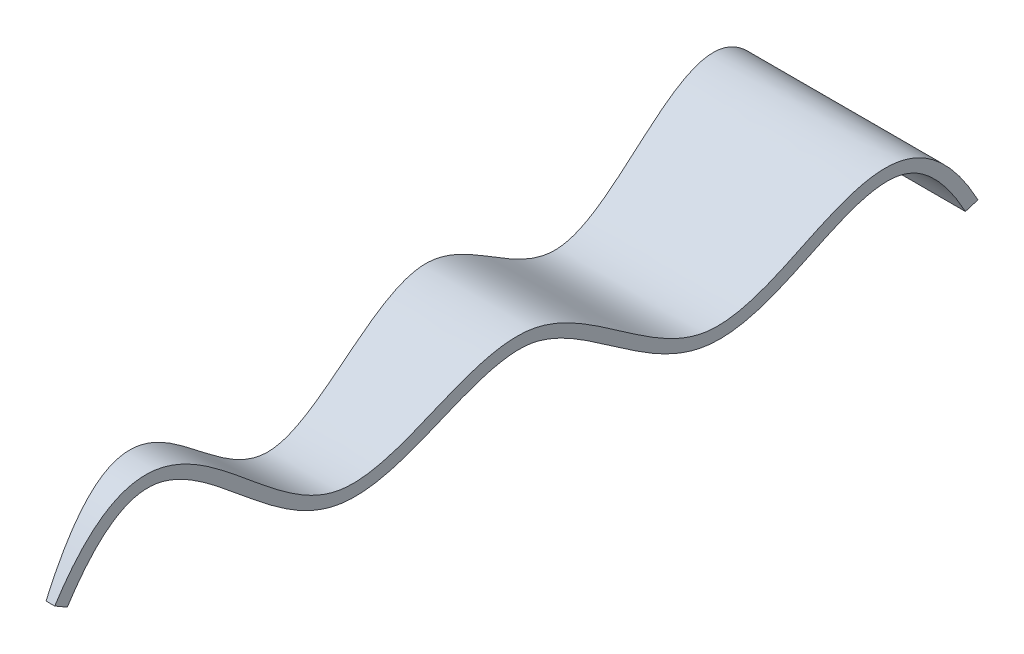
ISO-10303-21;
HEADER;
FILE_DESCRIPTION(('STEP AP214'),'2;1');
FILE_NAME('part.step','',(''),(''),'','','');
FILE_SCHEMA(('AUTOMOTIVE_DESIGN { 1 0 10303 214 1 1 1 1 }'));
ENDSEC;
DATA;
#1=APPLICATION_CONTEXT('core data for automotive mechanical design processes');
#2=APPLICATION_PROTOCOL_DEFINITION('international standard','automotive_design',2000,#1);
#3=PRODUCT_CONTEXT('',#1,'mechanical');
#4=PRODUCT('Part','Part','',(#3));
#5=PRODUCT_RELATED_PRODUCT_CATEGORY('part','',(#4));
#6=PRODUCT_DEFINITION_FORMATION('','',#4);
#7=PRODUCT_DEFINITION_CONTEXT('part definition',#1,'design');
#8=PRODUCT_DEFINITION('design','',#6,#7);
#9=PRODUCT_DEFINITION_SHAPE('','',#8);
#10=(LENGTH_UNIT() NAMED_UNIT(*) SI_UNIT(.MILLI.,.METRE.));
#11=(NAMED_UNIT(*) PLANE_ANGLE_UNIT() SI_UNIT($,.RADIAN.));
#12=(NAMED_UNIT(*) SI_UNIT($,.STERADIAN.) SOLID_ANGLE_UNIT());
#13=UNCERTAINTY_MEASURE_WITH_UNIT(LENGTH_MEASURE(1.E-05),#10,'distance_accuracy_value','');
#14=(GEOMETRIC_REPRESENTATION_CONTEXT(3) GLOBAL_UNCERTAINTY_ASSIGNED_CONTEXT((#13)) GLOBAL_UNIT_ASSIGNED_CONTEXT((#10,
#11,#12)) REPRESENTATION_CONTEXT('',''));
#15=CARTESIAN_POINT('',(0.,0.,0.));
#16=DIRECTION('',(0.,0.,1.));
#17=DIRECTION('',(1.,0.,0.));
#18=AXIS2_PLACEMENT_3D('',#15,#16,#17);
#19=CARTESIAN_POINT('',(60.,5.48688446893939,70.2004182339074));
#20=CARTESIAN_POINT('',(60.,9.87735894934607,67.958434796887));
#21=CARTESIAN_POINT('',(60.,13.3294721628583,65.7955430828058));
#22=CARTESIAN_POINT('',(60.,17.2952142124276,62.7136154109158));
#23=CARTESIAN_POINT('',(60.,18.4151614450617,61.7139692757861));
#24=CARTESIAN_POINT('',(60.,20.292093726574,59.7821242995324));
#25=CARTESIAN_POINT('',(60.,21.0489093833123,58.8503831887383));
#26=CARTESIAN_POINT('',(60.,22.2537724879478,57.0621458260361));
#27=CARTESIAN_POINT('',(60.,22.7022874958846,56.2062757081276));
#28=CARTESIAN_POINT('',(60.,23.3564782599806,54.5549870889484));
#29=CARTESIAN_POINT('',(60.,23.5632064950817,53.7591060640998));
#30=CARTESIAN_POINT('',(60.,23.7863341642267,52.1827883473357));
#31=CARTESIAN_POINT('',(60.,23.8026135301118,51.4010107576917));
#32=CARTESIAN_POINT('',(60.,23.6634855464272,49.8090918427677));
#33=CARTESIAN_POINT('',(60.,23.50712377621,48.998791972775));
#34=CARTESIAN_POINT('',(60.,23.0280068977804,47.3359279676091));
#35=CARTESIAN_POINT('',(60.,22.7049327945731,46.4839407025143));
#36=CARTESIAN_POINT('',(60.,21.9074085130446,44.743823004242));
#37=CARTESIAN_POINT('',(60.,21.4330849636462,43.8560416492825));
#38=CARTESIAN_POINT('',(60.,19.8222281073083,41.152866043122));
#39=CARTESIAN_POINT('',(60.,18.4972489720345,39.2996885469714));
#40=CARTESIAN_POINT('',(60.,15.6066901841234,35.5303327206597));
#41=CARTESIAN_POINT('',(60.,14.0422737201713,33.6137630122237));
#42=CARTESIAN_POINT('',(60.,10.9480929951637,29.7075444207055));
#43=CARTESIAN_POINT('',(60.,9.41783244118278,27.7181767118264));
#44=CARTESIAN_POINT('',(60.,6.66661866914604,23.6120638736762));
#45=CARTESIAN_POINT('',(60.,5.44226534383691,21.4943947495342));
#46=CARTESIAN_POINT('',(60.,4.08120254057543,18.1448090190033));
#47=CARTESIAN_POINT('',(60.,3.70766189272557,16.9988542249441));
#48=CARTESIAN_POINT('',(60.,3.31001065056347,15.2319691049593));
#49=CARTESIAN_POINT('',(60.,3.20467407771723,14.6351256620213));
#50=CARTESIAN_POINT('',(60.,3.05618320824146,13.4271208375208));
#51=CARTESIAN_POINT('',(60.,3.01344154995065,12.8131352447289));
#52=CARTESIAN_POINT('',(60.,2.98695625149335,10.9801813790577));
#53=CARTESIAN_POINT('',(60.,3.10071871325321,9.77156886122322));
#54=CARTESIAN_POINT('',(60.,3.53080959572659,7.39596736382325));
#55=CARTESIAN_POINT('',(60.,3.84677443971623,6.22839916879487));
#56=CARTESIAN_POINT('',(60.,5.01798970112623,2.77957873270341));
#57=CARTESIAN_POINT('',(60.,6.09393401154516,0.549875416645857));
#58=CARTESIAN_POINT('',(60.,8.51768543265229,-3.83655293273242));
#59=CARTESIAN_POINT('',(60.,9.86815360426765,-5.99367049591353));
#60=CARTESIAN_POINT('',(60.,12.5724565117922,-10.255086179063));
#61=CARTESIAN_POINT('',(60.,13.926526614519,-12.3591761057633));
#62=CARTESIAN_POINT('',(60.,16.3702917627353,-16.4912047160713));
#63=CARTESIAN_POINT('',(60.,17.458576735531,-18.5191598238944));
#64=CARTESIAN_POINT('',(60.,18.705664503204,-21.4552443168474));
#65=CARTESIAN_POINT('',(60.,19.0574172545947,-22.4158500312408));
#66=CARTESIAN_POINT('',(60.,19.6099852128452,-24.2913967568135));
#67=CARTESIAN_POINT('',(60.,19.8108013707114,-25.2059731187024));
#68=CARTESIAN_POINT('',(60.,19.9878475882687,-26.5414584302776));
#69=CARTESIAN_POINT('',(60.,20.0262399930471,-26.9806521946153));
#70=CARTESIAN_POINT('',(60.,20.0603674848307,-27.8485215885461));
#71=CARTESIAN_POINT('',(60.,20.0561093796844,-28.2744771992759));
#72=CARTESIAN_POINT('',(60.,19.9767530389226,-29.563138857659));
#73=CARTESIAN_POINT('',(60.,19.835829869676,-30.4415734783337));
#74=CARTESIAN_POINT('',(60.,19.3907679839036,-32.2455232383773));
#75=CARTESIAN_POINT('',(60.,19.0864148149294,-33.1705147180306));
#76=CARTESIAN_POINT('',(60.,18.3352871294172,-35.0598174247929));
#77=CARTESIAN_POINT('',(60.,17.8886348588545,-36.0238446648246));
#78=CARTESIAN_POINT('',(60.,16.3804903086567,-38.960065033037));
#79=CARTESIAN_POINT('',(60.,15.1502992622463,-40.9744391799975));
#80=CARTESIAN_POINT('',(60.,12.5275112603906,-45.0750576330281));
#81=CARTESIAN_POINT('',(60.,11.1357160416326,-47.1613895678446));
#82=CARTESIAN_POINT('',(60.,8.49131165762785,-51.4160688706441));
#83=CARTESIAN_POINT('',(60.,7.23710944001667,-53.5841863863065));
#84=CARTESIAN_POINT('',(60.,5.70007664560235,-56.9467307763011));
#85=CARTESIAN_POINT('',(60.,5.24539307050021,-58.0865896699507));
#86=CARTESIAN_POINT('',(60.,4.50133215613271,-60.4151976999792));
#87=CARTESIAN_POINT('',(60.,4.21193582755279,-61.6044624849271));
#88=CARTESIAN_POINT('',(60.,3.94784464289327,-63.4270069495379));
#89=CARTESIAN_POINT('',(60.,3.88825141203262,-64.0408366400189));
#90=CARTESIAN_POINT('',(60.,3.83416847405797,-65.2790336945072));
#91=CARTESIAN_POINT('',(60.,3.84052536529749,-65.8986347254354));
#92=CARTESIAN_POINT('',(60.,3.95138826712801,-67.7372787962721));
#93=CARTESIAN_POINT('',(60.,4.14692297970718,-68.9423604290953));
#94=CARTESIAN_POINT('',(60.,4.72576053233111,-71.3024670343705));
#95=CARTESIAN_POINT('',(60.,5.10884398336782,-72.4579556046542));
#96=CARTESIAN_POINT('',(60.,6.01415354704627,-74.7256587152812));
#97=CARTESIAN_POINT('',(60.,6.53647857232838,-75.8381433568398));
#98=CARTESIAN_POINT('',(60.,8.25260971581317,-79.1249364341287));
#99=CARTESIAN_POINT('',(60.,9.5949812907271,-81.2502770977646));
#100=CARTESIAN_POINT('',(60.,12.4037248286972,-85.4152751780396));
#101=CARTESIAN_POINT('',(60.,13.8711006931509,-87.4546982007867));
#102=CARTESIAN_POINT('',(60.,16.6714246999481,-91.4517958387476));
#103=CARTESIAN_POINT('',(60.,18.0039852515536,-93.4097553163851));
#104=CARTESIAN_POINT('',(60.,20.2772908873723,-97.2077804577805));
#105=CARTESIAN_POINT('',(60.,21.21513124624,-99.0473122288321));
#106=CARTESIAN_POINT('',(60.,22.1674153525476,-101.655597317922));
#107=CARTESIAN_POINT('',(60.,22.4098325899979,-102.499277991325));
#108=CARTESIAN_POINT('',(60.,22.7324391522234,-104.129857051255));
#109=CARTESIAN_POINT('',(60.,22.8130661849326,-104.916192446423));
#110=CARTESIAN_POINT('',(60.,22.8071219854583,-106.446801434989));
#111=CARTESIAN_POINT('',(60.,22.7215316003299,-107.191444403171));
#112=CARTESIAN_POINT('',(60.,22.3626369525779,-108.682014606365));
#113=CARTESIAN_POINT('',(60.,22.0891892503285,-109.429356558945));
#114=CARTESIAN_POINT('',(60.,21.2991963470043,-110.967543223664));
#115=CARTESIAN_POINT('',(60.,20.7815198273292,-111.758616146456));
#116=CARTESIAN_POINT('',(60.,19.4361594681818,-113.393026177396));
#117=CARTESIAN_POINT('',(60.,18.6081463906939,-114.235652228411));
#118=CARTESIAN_POINT('',(60.,15.5819789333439,-116.82129825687));
#119=CARTESIAN_POINT('',(60.,12.839285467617,-118.618586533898));
#120=CARTESIAN_POINT('',(60.,9.23686178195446,-120.436238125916));
#121=B_SPLINE_CURVE_WITH_KNOTS('',3,(#19,#20,#21,#22,#23,#24,#25,#26,#27,#28,#29,#30,#31,#32,
#33,#34,#35,#36,#37,#38,#39,#40,#41,#42,#43,#44,#45,#46,#47,#48,#49,#50,#51,#52,#53,#54,#55,#56,
#57,#58,#59,#60,#61,#62,#63,#64,#65,#66,#67,#68,#69,#70,#71,#72,#73,#74,#75,#76,#77,#78,#79,#80,
#81,#82,#83,#84,#85,#86,#87,#88,#89,#90,#91,#92,#93,#94,#95,#96,#97,#98,#99,#100,#101,#102,#103,
#104,#105,#106,#107,#108,#109,#110,#111,#112,#113,#114,#115,#116,#117,#118,#119,#120),
.UNSPECIFIED.,.F.,.F.,(4,2,2,2,2,2,2,2,2,2,2,2,2,2,2,2,2,2,2,2,2,2,2,2,2,2,2,2,2,2,2,2,2,2,2,2,
2,2,2,2,2,2,2,2,2,2,2,2,2,2,4),(0.,0.0312499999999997,0.0468749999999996,0.0624999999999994,
0.0781249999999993,0.0937499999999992,0.109374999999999,0.124999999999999,0.140624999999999,
0.156249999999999,0.187499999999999,0.218749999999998,0.249999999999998,0.281249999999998,
0.296874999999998,0.304687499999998,0.312499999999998,0.328124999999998,0.343749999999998,
0.374999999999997,0.406249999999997,0.437499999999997,0.468749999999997,0.484374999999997,
0.499999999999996,0.507812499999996,0.515624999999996,0.531249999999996,0.546874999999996,
0.562499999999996,0.593749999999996,0.624999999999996,0.656249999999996,0.671874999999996,
0.687499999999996,0.695312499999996,0.703124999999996,0.718749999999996,0.734374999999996,
0.749999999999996,0.781249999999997,0.812499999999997,0.843749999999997,0.874999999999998,
0.890624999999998,0.906249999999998,0.921874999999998,0.937499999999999,0.953124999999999,
0.968749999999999,1.),.UNSPECIFIED.);
#122=DIRECTION('',(-1.,0.,0.));
#123=VECTOR('',#122,1.);
#124=SURFACE_OF_LINEAR_EXTRUSION('',#121,#123);
#125=DIRECTION('',(-1.,0.,0.));
#126=VECTOR('',#125,1.);
#127=CARTESIAN_POINT('',(60.,5.48688446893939,70.2004182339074));
#128=LINE('',#127,#126);
#129=CARTESIAN_POINT('',(27.2532156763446,5.48688446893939,70.2004182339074));
#130=VERTEX_POINT('',#129);
#131=CARTESIAN_POINT('',(24.4582495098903,5.48688446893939,70.2004182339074));
#132=VERTEX_POINT('',#131);
#133=EDGE_CURVE('E90',#130,#132,#128,.T.);
#134=ORIENTED_EDGE('',*,*,#133,.T.);
#135=CARTESIAN_POINT('',(24.4582495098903,5.48688446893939,70.2004182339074));
#136=CARTESIAN_POINT('',(24.4403213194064,5.88555363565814,69.996825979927));
#137=CARTESIAN_POINT('',(24.4221645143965,6.28289568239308,69.7906375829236));
#138=CARTESIAN_POINT('',(24.3852395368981,7.07713178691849,69.371318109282));
#139=CARTESIAN_POINT('',(24.3664681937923,7.47400667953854,69.1581510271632));
#140=CARTESIAN_POINT('',(24.3282963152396,8.26631696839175,68.7246717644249));
#141=CARTESIAN_POINT('',(24.3088931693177,8.66173604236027,68.5043299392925));
#142=CARTESIAN_POINT('',(24.2694343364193,9.45010125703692,68.0562360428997));
#143=CARTESIAN_POINT('',(24.2493766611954,9.84303447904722,67.8284613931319));
#144=CARTESIAN_POINT('',(24.2085801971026,10.6253627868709,67.3651773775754));
#145=CARTESIAN_POINT('',(24.1878401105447,11.0147490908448,67.1296532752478));
#146=CARTESIAN_POINT('',(24.145643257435,11.7888709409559,66.6504664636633));
#147=CARTESIAN_POINT('',(24.124185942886,12.1736026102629,66.4067975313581));
#148=CARTESIAN_POINT('',(24.0787366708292,12.9682525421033,65.89067630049));
#149=CARTESIAN_POINT('',(24.0546800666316,13.3776915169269,65.6174898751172));
#150=CARTESIAN_POINT('',(24.0055966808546,14.1883378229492,65.060099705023));
#151=CARTESIAN_POINT('',(23.9805709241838,14.5895531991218,64.775907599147));
#152=CARTESIAN_POINT('',(23.9294494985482,15.3820417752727,64.1953734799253));
#153=CARTESIAN_POINT('',(23.9033556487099,15.7733301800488,63.8990521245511));
#154=CARTESIAN_POINT('',(23.8499791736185,16.5440819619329,63.2929096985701));
#155=CARTESIAN_POINT('',(23.8226988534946,16.9235660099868,62.9831148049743));
#156=CARTESIAN_POINT('',(23.7668067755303,17.6686066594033,62.3484052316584));
#157=CARTESIAN_POINT('',(23.7381971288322,18.0341837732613,62.0235145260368));
#158=CARTESIAN_POINT('',(23.6794466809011,18.7488695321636,61.3563453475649));
#159=CARTESIAN_POINT('',(23.6493064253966,19.0979839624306,61.0140730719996));
#160=CARTESIAN_POINT('',(23.5977351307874,19.6616344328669,60.4284302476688));
#161=CARTESIAN_POINT('',(23.576787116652,19.8819179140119,60.1905449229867));
#162=CARTESIAN_POINT('',(23.5340678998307,20.3120381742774,59.7054261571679));
#163=CARTESIAN_POINT('',(23.5122964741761,20.5218720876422,59.4581901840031));
#164=CARTESIAN_POINT('',(23.4678716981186,20.9293081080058,58.9537031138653));
#165=CARTESIAN_POINT('',(23.4452179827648,21.1269050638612,58.6964478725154));
#166=CARTESIAN_POINT('',(23.3992720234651,21.5052093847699,58.1746862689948));
#167=CARTESIAN_POINT('',(23.3759911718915,21.6860957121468,57.9103092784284));
#168=CARTESIAN_POINT('',(23.3285024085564,22.0312037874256,57.3710276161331));
#169=CARTESIAN_POINT('',(23.3042947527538,22.1954300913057,57.0961258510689));
#170=CARTESIAN_POINT('',(23.2549447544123,22.504223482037,56.535708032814));
#171=CARTESIAN_POINT('',(23.2298030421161,22.6488035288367,56.2501991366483));
#172=CARTESIAN_POINT('',(23.1880836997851,22.8659795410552,55.7764349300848));
#173=CARTESIAN_POINT('',(23.1717785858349,22.9454189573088,55.5912743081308));
#174=CARTESIAN_POINT('',(23.1388313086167,23.094613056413,55.2171255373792));
#175=CARTESIAN_POINT('',(23.1221891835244,23.1643688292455,55.0281378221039));
#176=CARTESIAN_POINT('',(23.0885951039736,23.2933702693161,54.6466439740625));
#177=CARTESIAN_POINT('',(23.0716431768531,23.3526168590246,54.4541381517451));
#178=CARTESIAN_POINT('',(23.037478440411,23.4598267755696,54.0661639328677));
#179=CARTESIAN_POINT('',(23.0202658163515,23.5077977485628,53.8706976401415));
#180=CARTESIAN_POINT('',(22.9856196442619,23.5920381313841,53.477256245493));
#181=CARTESIAN_POINT('',(22.9681860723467,23.6283062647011,53.2792808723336));
#182=CARTESIAN_POINT('',(22.9331623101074,23.6890306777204,52.8815515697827));
#183=CARTESIAN_POINT('',(22.9155721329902,23.7134879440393,52.68179779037));
#184=CARTESIAN_POINT('',(22.8847075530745,23.7457865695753,52.3313000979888));
#185=CARTESIAN_POINT('',(22.8714539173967,23.7562536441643,52.180792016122));
#186=CARTESIAN_POINT('',(22.8449189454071,23.7704725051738,51.879461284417));
#187=CARTESIAN_POINT('',(22.8316376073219,23.7742238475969,51.7286386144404));
#188=CARTESIAN_POINT('',(22.7917920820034,23.7755724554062,51.2761534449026));
#189=CARTESIAN_POINT('',(22.7652196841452,23.7632711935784,50.9743977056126));
#190=CARTESIAN_POINT('',(22.7254798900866,23.7266034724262,50.5231132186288));
#191=CARTESIAN_POINT('',(22.7122398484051,23.7113203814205,50.372759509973));
#192=CARTESIAN_POINT('',(22.6858210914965,23.6749113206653,50.0727485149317));
#193=CARTESIAN_POINT('',(22.6726423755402,23.6537854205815,49.9230912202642));
#194=CARTESIAN_POINT('',(22.6332231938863,23.5821056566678,49.4754476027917));
#195=CARTESIAN_POINT('',(22.6070980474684,23.5232481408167,49.1787708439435));
#196=CARTESIAN_POINT('',(22.5386824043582,23.3421646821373,48.4018438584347));
#197=CARTESIAN_POINT('',(22.4967252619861,23.2034760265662,47.9253791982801));
#198=CARTESIAN_POINT('',(22.4347304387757,22.9644171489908,47.2213669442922));
#199=CARTESIAN_POINT('',(22.4142122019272,22.8795092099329,46.9883621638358));
#200=CARTESIAN_POINT('',(22.3734849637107,22.7005398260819,46.5258642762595));
#201=CARTESIAN_POINT('',(22.3532759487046,22.6064787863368,46.2963710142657));
#202=CARTESIAN_POINT('',(22.2929973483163,22.3115933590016,45.6118481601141));
#203=CARTESIAN_POINT('',(22.253387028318,22.0985056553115,45.1620339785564));
#204=CARTESIAN_POINT('',(22.1948359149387,21.7600647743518,44.4971284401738));
#205=CARTESIAN_POINT('',(22.1754653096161,21.6441319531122,44.2771561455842));
#206=CARTESIAN_POINT('',(22.1369877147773,21.4066920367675,43.8402051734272));
#207=CARTESIAN_POINT('',(22.1178807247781,21.285184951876,43.6232264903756));
#208=CARTESIAN_POINT('',(22.0773586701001,21.0205439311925,43.1630586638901));
#209=CARTESIAN_POINT('',(22.0559793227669,20.8767012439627,42.9202751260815));
#210=CARTESIAN_POINT('',(22.0135169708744,20.5834438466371,42.4380733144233));
#211=CARTESIAN_POINT('',(21.9924339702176,20.4340290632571,42.1986550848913));
#212=CARTESIAN_POINT('',(21.9505250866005,20.130352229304,41.7227384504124));
#213=CARTESIAN_POINT('',(21.9296993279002,19.9760879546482,41.4862414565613));
#214=CARTESIAN_POINT('',(21.8882879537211,19.6634366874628,41.0159745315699));
#215=CARTESIAN_POINT('',(21.8677023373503,19.5050497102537,40.7822045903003));
#216=CARTESIAN_POINT('',(21.806237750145,19.0243567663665,40.0842136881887));
#217=CARTESIAN_POINT('',(21.7656791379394,18.6967245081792,39.6236307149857));
#218=CARTESIAN_POINT('',(21.6852260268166,18.0309899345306,38.7100064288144));
#219=CARTESIAN_POINT('',(21.6453316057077,17.6928864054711,38.2569659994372));
#220=CARTESIAN_POINT('',(21.5659983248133,17.008655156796,37.3560584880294));
#221=CARTESIAN_POINT('',(21.5265601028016,16.6625178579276,36.9081986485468));
#222=CARTESIAN_POINT('',(21.4480371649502,15.9655977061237,36.0164933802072));
#223=CARTESIAN_POINT('',(21.4089522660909,15.614817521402,35.5726458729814));
#224=CARTESIAN_POINT('',(21.3309635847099,14.9108858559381,34.6870076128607));
#225=CARTESIAN_POINT('',(21.2920597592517,14.5577349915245,34.2452163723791));
#226=CARTESIAN_POINT('',(21.2142752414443,13.8511373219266,33.3618965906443));
#227=CARTESIAN_POINT('',(21.1753945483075,13.4976905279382,32.9203680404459));
#228=CARTESIAN_POINT('',(21.0894071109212,12.7190571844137,31.9438960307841));
#229=CARTESIAN_POINT('',(21.0422732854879,12.2942573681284,31.4086450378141));
#230=CARTESIAN_POINT('',(20.9475749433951,11.4507464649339,30.3332521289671));
#231=CARTESIAN_POINT('',(20.9000103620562,11.0320363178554,29.7931094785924));
#232=CARTESIAN_POINT('',(20.8041704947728,10.2048412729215,28.7047534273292));
#233=CARTESIAN_POINT('',(20.7558949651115,9.79636001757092,28.1565372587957));
#234=CARTESIAN_POINT('',(20.6827965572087,9.1950301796,27.3264328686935));
#235=CARTESIAN_POINT('',(20.6583283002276,8.99657931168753,27.0485717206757));
#236=CARTESIAN_POINT('',(20.6091244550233,8.6040251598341,26.4898136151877));
#237=CARTESIAN_POINT('',(20.5843888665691,8.40992187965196,26.208916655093));
#238=CARTESIAN_POINT('',(20.5346280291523,8.02673744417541,25.6438333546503));
#239=CARTESIAN_POINT('',(20.5096028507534,7.83765510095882,25.3596478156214));
#240=CARTESIAN_POINT('',(20.4592279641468,7.46520105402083,24.7875913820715));
#241=CARTESIAN_POINT('',(20.4338782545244,7.2818293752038,24.4997204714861));
#242=CARTESIAN_POINT('',(20.3573088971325,6.74181171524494,23.6302000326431));
#243=CARTESIAN_POINT('',(20.3055441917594,6.39506963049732,23.0423608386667));
#244=CARTESIAN_POINT('',(20.2065109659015,5.77464752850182,21.9177410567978));
#245=CARTESIAN_POINT('',(20.1594271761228,5.49716813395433,21.3830582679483));
#246=CARTESIAN_POINT('',(20.0877612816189,5.10565350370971,20.5692214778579));
#247=CARTESIAN_POINT('',(20.0636968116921,4.97925457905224,20.2959457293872));
#248=CARTESIAN_POINT('',(20.0152186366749,4.73545567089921,19.7454283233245));
#249=CARTESIAN_POINT('',(19.9908049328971,4.61805565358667,19.4681866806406));
#250=CARTESIAN_POINT('',(19.941696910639,4.39347895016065,18.910516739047));
#251=CARTESIAN_POINT('',(19.917003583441,4.28627423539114,18.6300996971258));
#252=CARTESIAN_POINT('',(19.8672759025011,4.08274298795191,18.0653929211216));
#253=CARTESIAN_POINT('',(19.8422415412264,3.98641669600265,17.7811031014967));
#254=CARTESIAN_POINT('',(19.7666491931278,3.71521450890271,16.9226775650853));
#255=CARTESIAN_POINT('',(19.7155829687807,3.55802708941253,16.3427703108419));
#256=CARTESIAN_POINT('',(19.6345051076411,3.35410024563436,15.422051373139));
#257=CARTESIAN_POINT('',(19.6048422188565,3.28888925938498,15.0852000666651));
#258=CARTESIAN_POINT('',(19.5452368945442,3.17763879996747,14.4083229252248));
#259=CARTESIAN_POINT('',(19.5152944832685,3.1315976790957,14.068297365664));
#260=CARTESIAN_POINT('',(19.470247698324,3.0779438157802,13.5567467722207));
#261=CARTESIAN_POINT('',(19.455211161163,3.06262779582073,13.3859920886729));
#262=CARTESIAN_POINT('',(19.4251043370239,3.03711003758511,13.0440994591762));
#263=CARTESIAN_POINT('',(19.4100340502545,3.02690826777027,12.8729615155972));
#264=CARTESIAN_POINT('',(19.3798706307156,3.01173418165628,12.5304261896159));
#265=CARTESIAN_POINT('',(19.3647774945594,3.00676273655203,12.3590287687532));
#266=CARTESIAN_POINT('',(19.3345854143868,3.00205535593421,12.0161679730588));
#267=CARTESIAN_POINT('',(19.3194864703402,3.0023194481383,11.8447045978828));
#268=CARTESIAN_POINT('',(19.2741927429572,3.01066314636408,11.3303497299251));
#269=CARTESIAN_POINT('',(19.2440062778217,3.02629668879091,10.987552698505));
#270=CARTESIAN_POINT('',(19.18375711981,3.07665693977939,10.3033641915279));
#271=CARTESIAN_POINT('',(19.1536944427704,3.11138601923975,9.96197289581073));
#272=CARTESIAN_POINT('',(19.0830467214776,3.21428822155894,9.15969846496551));
#273=CARTESIAN_POINT('',(19.0425451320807,3.28998134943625,8.69976304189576));
#274=CARTESIAN_POINT('',(18.9620450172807,3.4707706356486,7.78560498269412));
#275=CARTESIAN_POINT('',(18.9220466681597,3.57587681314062,7.3313843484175));
#276=CARTESIAN_POINT('',(18.8426410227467,3.81206539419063,6.42965506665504));
#277=CARTESIAN_POINT('',(18.8032338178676,3.94315177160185,5.98214745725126));
#278=CARTESIAN_POINT('',(18.7445227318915,4.15692905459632,5.31542527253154));
#279=CARTESIAN_POINT('',(18.7249790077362,4.23121753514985,5.09348704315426));
#280=CARTESIAN_POINT('',(18.6860495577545,4.38499696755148,4.65140481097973));
#281=CARTESIAN_POINT('',(18.666663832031,4.46448792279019,4.43126080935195));
#282=CARTESIAN_POINT('',(18.6087547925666,4.7102002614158,3.77364665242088));
#283=CARTESIAN_POINT('',(18.5704680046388,4.88370384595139,3.33886248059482));
#284=CARTESIAN_POINT('',(18.4945156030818,5.24738599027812,2.47634818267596));
#285=CARTESIAN_POINT('',(18.4568499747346,5.43756415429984,2.04861788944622));
#286=CARTESIAN_POINT('',(18.3589433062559,5.95422484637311,0.936791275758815));
#287=CARTESIAN_POINT('',(18.2991675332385,6.29218022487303,0.257978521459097));
#288=CARTESIAN_POINT('',(18.2104520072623,6.81951543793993,-0.749473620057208));
#289=CARTESIAN_POINT('',(18.1810365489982,6.99870492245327,-1.08351510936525));
#290=CARTESIAN_POINT('',(18.1224794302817,7.36281288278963,-1.74848884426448));
#291=CARTESIAN_POINT('',(18.0933377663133,7.54773128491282,-2.07942112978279));
#292=CARTESIAN_POINT('',(18.0064194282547,8.10893698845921,-3.06646443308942));
#293=CARTESIAN_POINT('',(17.9490064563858,8.49253506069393,-3.71844525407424));
#294=CARTESIAN_POINT('',(17.8348858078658,9.27292931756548,-5.01439757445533));
#295=CARTESIAN_POINT('',(17.7781780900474,9.66972472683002,-5.65836954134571));
#296=CARTESIAN_POINT('',(17.6854420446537,10.3272143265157,-6.71147863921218));
#297=CARTESIAN_POINT('',(17.6492915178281,10.5856803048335,-7.1220034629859));
#298=CARTESIAN_POINT('',(17.5770818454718,11.1042678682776,-7.94201538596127));
#299=CARTESIAN_POINT('',(17.5410227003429,11.364389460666,-8.3515024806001));
#300=CARTESIAN_POINT('',(17.4689189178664,11.8849761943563,-9.17031191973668));
#301=CARTESIAN_POINT('',(17.4328742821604,12.1454413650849,-9.57963424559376));
#302=CARTESIAN_POINT('',(17.3607309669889,12.6653966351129,-10.3988926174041));
#303=CARTESIAN_POINT('',(17.3246322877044,12.9248867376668,-10.8088286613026));
#304=CARTESIAN_POINT('',(17.2522199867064,13.4421156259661,-11.6311416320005));
#305=CARTESIAN_POINT('',(17.2159060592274,13.6998488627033,-12.0435220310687));
#306=CARTESIAN_POINT('',(17.1430676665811,14.2114423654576,-12.870673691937));
#307=CARTESIAN_POINT('',(17.1065431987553,14.4653025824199,-13.2854449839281));
#308=CARTESIAN_POINT('',(17.033204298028,14.9674128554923,-14.1182804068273));
#309=CARTESIAN_POINT('',(16.9963899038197,15.2156636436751,-14.5363440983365));
#310=CARTESIAN_POINT('',(16.9223797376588,15.7046488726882,-15.3768024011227));
#311=CARTESIAN_POINT('',(16.8851839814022,15.9453836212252,-15.7991968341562));
#312=CARTESIAN_POINT('',(16.810626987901,16.4155287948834,-16.6458648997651));
#313=CARTESIAN_POINT('',(16.7732693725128,16.6450135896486,-17.0700974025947));
#314=CARTESIAN_POINT('',(16.6980137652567,17.0922980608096,-17.9246989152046));
#315=CARTESIAN_POINT('',(16.6601157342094,17.3100968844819,-18.3550683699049));
#316=CARTESIAN_POINT('',(16.5836801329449,17.7311265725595,-19.2230698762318));
#317=CARTESIAN_POINT('',(16.5451423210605,17.9343517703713,-19.6607046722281));
#318=CARTESIAN_POINT('',(16.4674562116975,18.3217809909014,-20.5429069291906));
#319=CARTESIAN_POINT('',(16.4283098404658,18.5060348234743,-20.9874525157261));
#320=CARTESIAN_POINT('',(16.3492641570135,18.8519794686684,-21.8850940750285));
#321=CARTESIAN_POINT('',(16.3093650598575,19.0136766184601,-22.3381876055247));
#322=CARTESIAN_POINT('',(16.228781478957,19.3090918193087,-23.253293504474));
#323=CARTESIAN_POINT('',(16.1880973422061,19.4428219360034,-23.7153019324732));
#324=CARTESIAN_POINT('',(16.1218345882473,19.6308741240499,-24.4677807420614));
#325=CARTESIAN_POINT('',(16.0964892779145,19.6959191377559,-24.7556016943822));
#326=CARTESIAN_POINT('',(16.0455442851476,19.8113714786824,-25.3341322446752));
#327=CARTESIAN_POINT('',(16.019944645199,19.8617812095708,-25.6248413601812));
#328=CARTESIAN_POINT('',(15.9685415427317,19.9461205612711,-26.2085741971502));
#329=CARTESIAN_POINT('',(15.9427381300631,19.9800540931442,-26.5015973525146));
#330=CARTESIAN_POINT('',(15.891098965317,20.0295730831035,-27.0880109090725));
#331=CARTESIAN_POINT('',(15.8652637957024,20.0452343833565,-27.3813946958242));
#332=CARTESIAN_POINT('',(15.8264871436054,20.0538732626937,-27.8217417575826));
#333=CARTESIAN_POINT('',(15.8135561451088,20.0542765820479,-27.9685859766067));
#334=CARTESIAN_POINT('',(15.7877003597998,20.0499505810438,-28.2622038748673));
#335=CARTESIAN_POINT('',(15.7747755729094,20.0452213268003,-28.408977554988));
#336=CARTESIAN_POINT('',(15.7489509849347,20.030621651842,-28.7022411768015));
#337=CARTESIAN_POINT('',(15.7360511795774,20.0207522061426,-28.8487311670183));
#338=CARTESIAN_POINT('',(15.7102877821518,19.9961365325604,-29.1412999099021));
#339=CARTESIAN_POINT('',(15.6974241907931,19.9813902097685,-29.28737865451));
#340=CARTESIAN_POINT('',(15.6590401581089,19.9303626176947,-29.7232671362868));
#341=CARTESIAN_POINT('',(15.6335881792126,19.887209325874,-30.0122994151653));
#342=CARTESIAN_POINT('',(15.582936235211,19.7844565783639,-30.5875021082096));
#343=CARTESIAN_POINT('',(15.5577363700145,19.72485085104,-30.873671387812));
#344=CARTESIAN_POINT('',(15.5076323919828,19.5910753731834,-31.4426513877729));
#345=CARTESIAN_POINT('',(15.4827283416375,19.5169026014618,-31.7254613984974));
#346=CARTESIAN_POINT('',(15.4331045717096,19.3553522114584,-32.2889881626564));
#347=CARTESIAN_POINT('',(15.4083866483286,19.267903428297,-32.5696845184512));
#348=CARTESIAN_POINT('',(15.3592895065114,19.0818219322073,-33.1272309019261));
#349=CARTESIAN_POINT('',(15.3349101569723,18.9831936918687,-33.4040824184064));
#350=CARTESIAN_POINT('',(15.2864888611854,18.7761696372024,-33.953953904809));
#351=CARTESIAN_POINT('',(15.2624467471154,18.6677788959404,-34.2269757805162));
#352=CARTESIAN_POINT('',(15.199345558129,18.3702023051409,-34.9435519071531));
#353=CARTESIAN_POINT('',(15.1605483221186,18.1737965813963,-35.3841327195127));
#354=CARTESIAN_POINT('',(15.0836941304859,17.7628985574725,-36.256887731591));
#355=CARTESIAN_POINT('',(15.0456373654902,17.5484016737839,-36.6890597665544));
#356=CARTESIAN_POINT('',(14.9701147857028,17.10455311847,-37.5466930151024));
#357=CARTESIAN_POINT('',(14.9326501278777,16.8751759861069,-37.9721410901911));
#358=CARTESIAN_POINT('',(14.858270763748,16.4052507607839,-38.8167919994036));
#359=CARTESIAN_POINT('',(14.8213560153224,16.1647035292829,-39.2359953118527));
#360=CARTESIAN_POINT('',(14.7478514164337,15.6743337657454,-40.0707124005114));
#361=CARTESIAN_POINT('',(14.7112629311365,15.4244847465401,-40.4862106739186));
#362=CARTESIAN_POINT('',(14.6384259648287,14.9184373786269,-41.3133461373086));
#363=CARTESIAN_POINT('',(14.6021774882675,14.6622389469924,-41.7249832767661));
#364=CARTESIAN_POINT('',(14.5298808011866,14.1450012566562,-42.5459833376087));
#365=CARTESIAN_POINT('',(14.4938329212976,13.8839560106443,-42.955342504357));
#366=CARTESIAN_POINT('',(14.4218922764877,13.3591149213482,-43.7722993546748));
#367=CARTESIAN_POINT('',(14.385999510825,13.0953190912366,-44.1798970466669));
#368=CARTESIAN_POINT('',(14.2780787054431,12.3000655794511,-45.4054440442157));
#369=CARTESIAN_POINT('',(14.2061351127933,11.7671259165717,-46.2224343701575));
#370=CARTESIAN_POINT('',(14.0618855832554,10.7114128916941,-47.8605297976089));
#371=CARTESIAN_POINT('',(13.9895807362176,10.1886203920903,-48.6816225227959));
#372=CARTESIAN_POINT('',(13.8439382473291,9.16579956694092,-50.3355363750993));
#373=CARTESIAN_POINT('',(13.7706030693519,8.66572610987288,-51.1683295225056));
#374=CARTESIAN_POINT('',(13.6220424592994,7.70396140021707,-52.8553815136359));
#375=CARTESIAN_POINT('',(13.5468182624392,7.24224587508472,-53.7096263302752));
#376=CARTESIAN_POINT('',(13.4308353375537,6.58541593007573,-55.0267266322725));
#377=CARTESIAN_POINT('',(13.3909923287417,6.36931004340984,-55.4791832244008));
#378=CARTESIAN_POINT('',(13.3105505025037,5.95535228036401,-56.3926793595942));
#379=CARTESIAN_POINT('',(13.2699512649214,5.75751093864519,-56.8537236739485));
#380=CARTESIAN_POINT('',(13.1879457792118,5.38401828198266,-57.7849767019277));
#381=CARTESIAN_POINT('',(13.1465391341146,5.20837821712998,-58.2551899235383));
#382=CARTESIAN_POINT('',(13.0632366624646,4.88444321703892,-59.2011715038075));
#383=CARTESIAN_POINT('',(13.0213465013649,4.73596057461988,-59.6768755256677));
#384=CARTESIAN_POINT('',(12.9368430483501,4.46912885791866,-60.6364954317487));
#385=CARTESIAN_POINT('',(12.8942299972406,4.35076995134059,-61.1204085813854));
#386=CARTESIAN_POINT('',(12.8083938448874,4.14855541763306,-62.0951626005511));
#387=CARTESIAN_POINT('',(12.7651711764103,4.06467647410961,-62.58599855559));
#388=CARTESIAN_POINT('',(12.7051869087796,3.97540020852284,-63.2671789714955));
#389=CARTESIAN_POINT('',(12.6886060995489,3.95356091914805,-63.4554703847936));
#390=CARTESIAN_POINT('',(12.6553932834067,3.91567260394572,-63.8326346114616));
#391=CARTESIAN_POINT('',(12.6387612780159,3.89962340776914,-64.0215074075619));
#392=CARTESIAN_POINT('',(12.6054608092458,3.8734958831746,-64.399667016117));
#393=CARTESIAN_POINT('',(12.5887923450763,3.86341768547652,-64.5889538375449));
#394=CARTESIAN_POINT('',(12.5554352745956,3.84947082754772,-64.9677562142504));
#395=CARTESIAN_POINT('',(12.5387466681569,3.84560220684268,-65.1572717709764));
#396=CARTESIAN_POINT('',(12.5053699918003,3.84393695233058,-65.5362967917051));
#397=CARTESIAN_POINT('',(12.488681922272,3.84613928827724,-65.7258062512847));
#398=CARTESIAN_POINT('',(12.4553206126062,3.85651483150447,-66.1046567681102));
#399=CARTESIAN_POINT('',(12.4386473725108,3.86468805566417,-66.2939978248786));
#400=CARTESIAN_POINT('',(12.3886137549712,3.89804074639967,-66.8621788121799));
#401=CARTESIAN_POINT('',(12.355295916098,3.93205536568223,-67.2405356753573));
#402=CARTESIAN_POINT('',(12.2888868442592,4.02217190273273,-67.9946760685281));
#403=CARTESIAN_POINT('',(12.2557956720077,4.07827951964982,-68.3704589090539));
#404=CARTESIAN_POINT('',(12.1899306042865,4.21104150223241,-69.1184215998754));
#405=CARTESIAN_POINT('',(12.1571567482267,4.2876983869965,-69.4906010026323));
#406=CARTESIAN_POINT('',(12.0779536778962,4.49694498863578,-70.3900298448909));
#407=CARTESIAN_POINT('',(12.0317242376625,4.63940389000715,-70.9150106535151));
#408=CARTESIAN_POINT('',(11.9401600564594,4.95798528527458,-71.9548120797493));
#409=CARTESIAN_POINT('',(11.8948256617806,5.13412053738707,-72.4696287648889));
#410=CARTESIAN_POINT('',(11.8050923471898,5.5151066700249,-73.4886388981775));
#411=CARTESIAN_POINT('',(11.7606936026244,5.71996287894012,-73.9928303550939));
#412=CARTESIAN_POINT('',(11.6726530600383,6.15478040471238,-74.9926173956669));
#413=CARTESIAN_POINT('',(11.6290148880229,6.38483648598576,-75.4881718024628));
#414=CARTESIAN_POINT('',(11.5426303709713,6.86532414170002,-76.4691530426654));
#415=CARTESIAN_POINT('',(11.4998837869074,7.1157501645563,-76.9545825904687));
#416=CARTESIAN_POINT('',(11.4151821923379,7.63331733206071,-77.9164525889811));
#417=CARTESIAN_POINT('',(11.3732271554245,7.90045791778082,-78.3928933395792));
#418=CARTESIAN_POINT('',(11.292985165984,8.42905994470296,-79.3041201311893));
#419=CARTESIAN_POINT('',(11.2546498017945,8.68957054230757,-79.7394559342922));
#420=CARTESIAN_POINT('',(11.1785037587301,9.22038168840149,-80.6041692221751));
#421=CARTESIAN_POINT('',(11.1406931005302,9.49068262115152,-81.0335464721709));
#422=CARTESIAN_POINT('',(11.0655076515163,10.0391170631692,-81.8873512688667));
#423=CARTESIAN_POINT('',(11.0281329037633,10.3172513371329,-82.3117783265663));
#424=CARTESIAN_POINT('',(10.9537293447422,10.8794393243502,-83.156703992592));
#425=CARTESIAN_POINT('',(10.9167005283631,11.1634929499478,-83.5772026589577));
#426=CARTESIAN_POINT('',(10.8430205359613,11.7350572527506,-84.4139115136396));
#427=CARTESIAN_POINT('',(10.8063685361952,12.0225541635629,-84.8301310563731));
#428=CARTESIAN_POINT('',(10.7332405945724,12.6004346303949,-85.6605708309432));
#429=CARTESIAN_POINT('',(10.6967646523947,12.8908181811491,-86.0747910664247));
#430=CARTESIAN_POINT('',(10.6239049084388,13.4729950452,-86.9021851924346));
#431=CARTESIAN_POINT('',(10.5875210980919,13.7647882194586,-87.3153591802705));
#432=CARTESIAN_POINT('',(10.5147519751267,14.3483499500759,-88.1417242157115));
#433=CARTESIAN_POINT('',(10.4783666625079,14.6401185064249,-88.5549152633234));
#434=CARTESIAN_POINT('',(10.3921731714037,15.3284618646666,-89.5337272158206));
#435=CARTESIAN_POINT('',(10.3423222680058,15.7243444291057,-90.0998333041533));
#436=CARTESIAN_POINT('',(10.2421966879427,16.5090700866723,-91.2368578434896));
#437=CARTESIAN_POINT('',(10.1919220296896,16.8979134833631,-91.807776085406));
#438=CARTESIAN_POINT('',(10.0904338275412,17.6659165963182,-92.9602745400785));
#439=CARTESIAN_POINT('',(10.0392168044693,18.0450168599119,-93.5418942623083));
#440=CARTESIAN_POINT('',(9.93579749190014,18.7853247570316,-94.7163223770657));
#441=CARTESIAN_POINT('',(9.88359536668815,19.1465353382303,-95.3091289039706));
#442=CARTESIAN_POINT('',(9.7949473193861,19.7302116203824,-96.3158147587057));
#443=CARTESIAN_POINT('',(9.75886238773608,19.9597858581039,-96.7255946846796));
#444=CARTESIAN_POINT('',(9.68598170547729,20.4041347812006,-97.5532265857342));
#445=CARTESIAN_POINT('',(9.64918580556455,20.6189063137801,-97.9710802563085));
#446=CARTESIAN_POINT('',(9.59337205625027,20.9270798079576,-98.6049003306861));
#447=CARTESIAN_POINT('',(9.57465286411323,21.0275291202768,-98.8174751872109));
#448=CARTESIAN_POINT('',(9.53700053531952,21.2230948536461,-99.2450544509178));
#449=CARTESIAN_POINT('',(9.51806739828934,21.318211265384,-99.4600588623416));
#450=CARTESIAN_POINT('',(9.4801129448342,21.5017417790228,-99.8910690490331));
#451=CARTESIAN_POINT('',(9.46109324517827,21.5901992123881,-100.107056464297));
#452=CARTESIAN_POINT('',(9.42282020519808,21.7602993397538,-100.541684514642));
#453=CARTESIAN_POINT('',(9.40356686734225,21.8419421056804,-100.760325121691));
#454=CARTESIAN_POINT('',(9.36484071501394,21.9975298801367,-101.200098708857));
#455=CARTESIAN_POINT('',(9.3453681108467,22.0714816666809,-101.421229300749));
#456=CARTESIAN_POINT('',(9.30618798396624,22.2108708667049,-101.866158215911));
#457=CARTESIAN_POINT('',(9.2864804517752,22.2763079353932,-102.08995664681));
#458=CARTESIAN_POINT('',(9.24687185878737,22.3974909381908,-102.539751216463));
#459=CARTESIAN_POINT('',(9.22697118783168,22.4532532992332,-102.765742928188));
#460=CARTESIAN_POINT('',(9.18696376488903,22.553999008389,-103.220066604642));
#461=CARTESIAN_POINT('',(9.16685704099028,22.5989838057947,-103.448398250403));
#462=CARTESIAN_POINT('',(9.12008930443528,22.6892522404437,-103.97949194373));
#463=CARTESIAN_POINT('',(9.09336048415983,22.7301585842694,-104.283024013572));
#464=CARTESIAN_POINT('',(9.05312310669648,22.7736998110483,-104.739959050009));
#465=CARTESIAN_POINT('',(9.03968556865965,22.7852440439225,-104.892555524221));
#466=CARTESIAN_POINT('',(9.01277915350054,22.8020525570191,-105.198104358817));
#467=CARTESIAN_POINT('',(8.99931027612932,22.8073167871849,-105.351056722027));
#468=CARTESIAN_POINT('',(8.97239968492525,22.811260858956,-105.656652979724));
#469=CARTESIAN_POINT('',(8.9589579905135,22.8099576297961,-105.809296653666));
#470=CARTESIAN_POINT('',(8.93209230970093,22.8005669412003,-106.114382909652));
#471=CARTESIAN_POINT('',(8.91866832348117,22.792479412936,-106.26682548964));
#472=CARTESIAN_POINT('',(8.89186723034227,22.769218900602,-106.571178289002));
#473=CARTESIAN_POINT('',(8.87849012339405,22.7540459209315,-106.723088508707));
#474=CARTESIAN_POINT('',(8.8518154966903,22.7164769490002,-107.026005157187));
#475=CARTESIAN_POINT('',(8.83851797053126,22.6940815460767,-107.17701165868));
#476=CARTESIAN_POINT('',(8.80752164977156,22.6331807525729,-107.529005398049));
#477=CARTESIAN_POINT('',(8.78986596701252,22.5917864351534,-107.729503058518));
#478=CARTESIAN_POINT('',(8.7548184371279,22.4963361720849,-108.127502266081));
#479=CARTESIAN_POINT('',(8.73742662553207,22.4422785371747,-108.3250034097));
#480=CARTESIAN_POINT('',(8.70297904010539,22.3217600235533,-108.716189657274));
#481=CARTESIAN_POINT('',(8.68592322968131,22.2553005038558,-108.909875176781));
#482=CARTESIAN_POINT('',(8.65216788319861,22.1104585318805,-109.293200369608));
#483=CARTESIAN_POINT('',(8.63546913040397,22.0320524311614,-109.482831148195));
#484=CARTESIAN_POINT('',(8.60249706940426,21.864362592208,-109.857261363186));
#485=CARTESIAN_POINT('',(8.58622379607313,21.7750779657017,-110.042060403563));
#486=CARTESIAN_POINT('',(8.55412300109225,21.586641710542,-110.406596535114));
#487=CARTESIAN_POINT('',(8.53829551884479,21.4874892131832,-110.586333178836));
#488=CARTESIAN_POINT('',(8.50135749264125,21.2419754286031,-111.005800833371));
#489=CARTESIAN_POINT('',(8.48044792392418,21.091675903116,-111.243249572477));
#490=CARTESIAN_POINT('',(8.43948951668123,20.7764654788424,-111.708372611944));
#491=CARTESIAN_POINT('',(8.41944098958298,20.6115493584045,-111.936043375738));
#492=CARTESIAN_POINT('',(8.38017788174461,20.2692557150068,-112.381914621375));
#493=CARTESIAN_POINT('',(8.36096344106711,20.0918761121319,-112.600113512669));
#494=CARTESIAN_POINT('',(8.32319401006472,19.7250974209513,-113.029022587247));
#495=CARTESIAN_POINT('',(8.30464499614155,19.5356186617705,-113.239664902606));
#496=CARTESIAN_POINT('',(8.26831416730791,19.1474678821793,-113.652237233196));
#497=CARTESIAN_POINT('',(8.25053215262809,18.9487982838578,-113.854169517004));
#498=CARTESIAN_POINT('',(8.21568264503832,18.5435492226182,-114.249919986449));
#499=CARTESIAN_POINT('',(8.19861506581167,18.3369707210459,-114.443739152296));
#500=CARTESIAN_POINT('',(8.16053106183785,17.8591081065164,-114.876220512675));
#501=CARTESIAN_POINT('',(8.1397220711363,17.5856761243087,-115.112527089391));
#502=CARTESIAN_POINT('',(8.099089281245,17.0293725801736,-115.573952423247));
#503=CARTESIAN_POINT('',(8.07926575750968,16.7464984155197,-115.79906805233));
#504=CARTESIAN_POINT('',(8.04049523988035,16.1726857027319,-116.239345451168));
#505=CARTESIAN_POINT('',(8.0215490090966,15.8817404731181,-116.454498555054));
#506=CARTESIAN_POINT('',(7.98445070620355,15.2929481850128,-116.875786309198));
#507=CARTESIAN_POINT('',(7.96629939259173,14.995094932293,-117.081912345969));
#508=CARTESIAN_POINT('',(7.93072498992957,14.3935098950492,-117.48589471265));
#509=CARTESIAN_POINT('',(7.91330239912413,14.0897742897,-117.683745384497));
#510=CARTESIAN_POINT('',(7.87977577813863,13.4888753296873,-118.064473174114));
#511=CARTESIAN_POINT('',(7.86364680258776,13.1918924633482,-118.247633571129));
#512=CARTESIAN_POINT('',(7.8319754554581,12.5940921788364,-118.60729289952));
#513=CARTESIAN_POINT('',(7.81643280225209,12.2932766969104,-118.783795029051));
#514=CARTESIAN_POINT('',(7.78590361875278,11.6885558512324,-119.130483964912));
#515=CARTESIAN_POINT('',(7.77091635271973,11.3846553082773,-119.300679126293));
#516=CARTESIAN_POINT('',(7.74147222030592,10.7744803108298,-119.635046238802));
#517=CARTESIAN_POINT('',(7.7270141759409,10.4682132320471,-119.799231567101));
#518=CARTESIAN_POINT('',(7.69860770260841,9.85398345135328,-120.121815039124));
#519=CARTESIAN_POINT('',(7.68465767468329,9.54603036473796,-120.280231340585));
#520=CARTESIAN_POINT('',(7.67091982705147,9.23686178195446,-120.436238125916));
#521=B_SPLINE_CURVE_WITH_KNOTS('',3,(#135,#136,#137,#138,#139,#140,#141,#142,#143,#144,#145,
#146,#147,#148,#149,#150,#151,#152,#153,#154,#155,#156,#157,#158,#159,#160,#161,#162,#163,#164,
#165,#166,#167,#168,#169,#170,#171,#172,#173,#174,#175,#176,#177,#178,#179,#180,#181,#182,#183,
#184,#185,#186,#187,#188,#189,#190,#191,#192,#193,#194,#195,#196,#197,#198,#199,#200,#201,#202,
#203,#204,#205,#206,#207,#208,#209,#210,#211,#212,#213,#214,#215,#216,#217,#218,#219,#220,#221,
#222,#223,#224,#225,#226,#227,#228,#229,#230,#231,#232,#233,#234,#235,#236,#237,#238,#239,#240,
#241,#242,#243,#244,#245,#246,#247,#248,#249,#250,#251,#252,#253,#254,#255,#256,#257,#258,#259,
#260,#261,#262,#263,#264,#265,#266,#267,#268,#269,#270,#271,#272,#273,#274,#275,#276,#277,#278,
#279,#280,#281,#282,#283,#284,#285,#286,#287,#288,#289,#290,#291,#292,#293,#294,#295,#296,#297,
#298,#299,#300,#301,#302,#303,#304,#305,#306,#307,#308,#309,#310,#311,#312,#313,#314,#315,#316,
#317,#318,#319,#320,#321,#322,#323,#324,#325,#326,#327,#328,#329,#330,#331,#332,#333,#334,#335,
#336,#337,#338,#339,#340,#341,#342,#343,#344,#345,#346,#347,#348,#349,#350,#351,#352,#353,#354,
#355,#356,#357,#358,#359,#360,#361,#362,#363,#364,#365,#366,#367,#368,#369,#370,#371,#372,#373,
#374,#375,#376,#377,#378,#379,#380,#381,#382,#383,#384,#385,#386,#387,#388,#389,#390,#391,#392,
#393,#394,#395,#396,#397,#398,#399,#400,#401,#402,#403,#404,#405,#406,#407,#408,#409,#410,#411,
#412,#413,#414,#415,#416,#417,#418,#419,#420,#421,#422,#423,#424,#425,#426,#427,#428,#429,#430,
#431,#432,#433,#434,#435,#436,#437,#438,#439,#440,#441,#442,#443,#444,#445,#446,#447,#448,#449,
#450,#451,#452,#453,#454,#455,#456,#457,#458,#459,#460,#461,#462,#463,#464,#465,#466,#467,#468,
#469,#470,#471,#472,#473,#474,#475,#476,#477,#478,#479,#480,#481,#482,#483,#484,#485,#486,#487,
#488,#489,#490,#491,#492,#493,#494,#495,#496,#497,#498,#499,#500,#501,#502,#503,#504,#505,#506,
#507,#508,#509,#510,#511,#512,#513,#514,#515,#516,#517,#518,#519,#520),.UNSPECIFIED.,.F.,.F.,(4,
2,2,2,2,2,2,2,2,2,2,2,2,2,2,2,2,2,2,2,2,2,2,2,2,2,2,2,2,2,2,2,2,2,2,2,2,2,2,2,2,2,2,2,2,2,2,2,2,
2,2,2,2,2,2,2,2,2,2,2,2,2,2,2,2,2,2,2,2,2,2,2,2,2,2,2,2,2,2,2,2,2,2,2,2,2,2,2,2,2,2,2,2,2,2,2,2,
2,2,2,2,2,2,2,2,2,2,2,2,2,2,2,2,2,2,2,2,2,2,2,2,2,2,2,2,2,2,2,2,2,2,2,2,2,2,2,2,2,2,2,2,2,2,2,2,
2,2,2,2,2,2,2,2,2,2,2,2,2,2,2,2,2,2,2,2,2,2,2,2,2,2,2,2,2,2,2,2,2,2,2,2,2,2,2,2,2,2,2,2,2,2,2,
4),(0.,1.34401679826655,2.69664086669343,4.05582649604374,5.41961745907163,6.78617165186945,
8.15379496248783,9.63201793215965,11.108718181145,12.5830002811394,14.0545359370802,
15.523809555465,16.9925629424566,17.9669758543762,18.9416545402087,19.91674076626,
20.8797429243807,21.8424810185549,22.804580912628,23.4107684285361,24.0168876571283,
24.6229536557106,25.2286074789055,25.8343273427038,26.4399965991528,26.8942046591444,
27.3484427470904,28.2566896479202,28.7117284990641,29.1667619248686,30.0767724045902,
31.5680452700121,32.3144349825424,33.0607916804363,34.5575074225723,35.3056779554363,
36.0538471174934,36.9027778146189,37.751719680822,38.601056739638,39.4503906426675,
41.1501999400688,42.8502069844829,44.5523573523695,46.2535686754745,47.9543536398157,
49.6550769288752,51.7099360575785,53.765109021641,55.8210037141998,56.8479527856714,
57.8749027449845,58.9016075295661,59.9283167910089,61.9807075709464,63.7923830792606,
64.6984029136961,65.6044193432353,66.50786825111,67.4113371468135,69.2175760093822,
70.2502987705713,71.2829327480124,71.7991641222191,72.3153923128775,72.831706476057,
73.3480233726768,74.3808353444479,75.4137755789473,76.8162744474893,78.219251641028,
79.6224435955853,80.3269582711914,81.0314734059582,82.4400867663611,83.8486667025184,
86.129593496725,87.2701860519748,88.4107639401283,90.6863940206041,92.9618906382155,
94.4212621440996,95.8806400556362,97.3401523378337,98.7996597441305,100.262597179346,
101.725553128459,103.188317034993,104.65102097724,106.102182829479,107.553450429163,
109.005279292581,110.453193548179,111.900700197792,113.347581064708,114.235765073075,
115.123803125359,116.011630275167,116.895759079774,117.337923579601,117.780082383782,
118.222157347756,118.664240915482,119.543681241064,120.423457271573,121.303415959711,
122.188269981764,123.072771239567,123.956815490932,125.408049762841,126.859652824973,
128.313808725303,129.767852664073,131.226412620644,132.684991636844,134.145511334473,
135.606024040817,138.54032265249,141.46840786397,144.39039642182,147.310521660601,
148.819190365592,150.328723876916,151.839019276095,153.338444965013,154.837380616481,
156.335300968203,156.906066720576,157.476815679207,158.047577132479,158.618342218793,
159.18901045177,159.759680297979,160.902946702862,162.046508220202,163.190209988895,
164.826622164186,166.463655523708,168.100992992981,169.744714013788,171.387988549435,
173.031208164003,174.557382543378,176.083616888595,177.610000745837,179.136362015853,
180.657898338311,182.179431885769,183.700818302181,185.222205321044,187.299960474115,
189.37762580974,191.465879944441,193.553788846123,194.966832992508,196.380177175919,
197.087689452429,197.795202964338,198.497621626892,199.200032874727,199.901819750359,
200.603635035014,201.304246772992,202.004764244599,202.926139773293,203.386899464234,
203.847662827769,204.307239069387,204.766819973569,205.226400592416,205.685943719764,
206.301963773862,206.918066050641,207.534100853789,208.151371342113,208.768692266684,
209.386067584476,210.230803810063,211.075843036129,211.921023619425,212.772498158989,
213.623749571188,214.474897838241,215.560523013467,216.646449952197,217.733304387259,
218.821174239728,219.909776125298,220.957567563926,222.004849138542,223.050689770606,
224.094040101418,225.133758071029),.UNSPECIFIED.);
#522=CARTESIAN_POINT('',(7.67091982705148,9.23686178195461,-120.436238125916));
#523=VERTEX_POINT('',#522);
#524=EDGE_CURVE('E63',#132,#523,#521,.T.);
#525=ORIENTED_EDGE('',*,*,#524,.T.);
#526=DIRECTION('',(-1.,0.,0.));
#527=VECTOR('',#526,1.);
#528=CARTESIAN_POINT('',(60.,9.23686178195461,-120.436238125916));
#529=LINE('',#528,#527);
#530=CARTESIAN_POINT('',(57.1183948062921,9.23686178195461,-120.436238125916));
#531=VERTEX_POINT('',#530);
#532=EDGE_CURVE('E86',#531,#523,#529,.T.);
#533=ORIENTED_EDGE('',*,*,#532,.F.);
#534=CARTESIAN_POINT('',(57.1183948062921,9.23686178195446,-120.436238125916));
#535=CARTESIAN_POINT('',(57.0870006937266,9.6339643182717,-120.235841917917));
#536=CARTESIAN_POINT('',(57.0549883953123,10.0290551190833,-120.031499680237));
#537=CARTESIAN_POINT('',(56.9894531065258,10.8162705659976,-119.613172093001));
#538=CARTESIAN_POINT('',(56.955923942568,11.2083737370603,-119.399147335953));
#539=CARTESIAN_POINT('',(56.8872718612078,11.9880930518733,-118.960924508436));
#540=CARTESIAN_POINT('',(56.8521449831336,12.3756946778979,-118.736701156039));
#541=CARTESIAN_POINT('',(56.7801882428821,13.1447744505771,-118.277383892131));
#542=CARTESIAN_POINT('',(56.7433567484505,13.5262462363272,-118.042279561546));
#543=CARTESIAN_POINT('',(56.6668130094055,14.2917478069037,-117.553682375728));
#544=CARTESIAN_POINT('',(56.6270496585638,14.6755649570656,-117.29986329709));
#545=CARTESIAN_POINT('',(56.545374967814,15.4329670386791,-116.778514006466));
#546=CARTESIAN_POINT('',(56.5034659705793,15.806562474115,-116.51099874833));
#547=CARTESIAN_POINT('',(56.4172403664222,16.5412333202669,-115.960599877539));
#548=CARTESIAN_POINT('',(56.3729270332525,16.9023247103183,-115.677737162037));
#549=CARTESIAN_POINT('',(56.2815304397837,17.6092706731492,-115.094330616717));
#550=CARTESIAN_POINT('',(56.2344491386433,17.955135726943,-114.793799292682));
#551=CARTESIAN_POINT('',(56.1607301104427,18.4651687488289,-114.323232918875));
#552=CARTESIAN_POINT('',(56.1352308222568,18.6362324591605,-114.160464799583));
#553=CARTESIAN_POINT('',(56.0833496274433,18.9727368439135,-113.829294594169));
#554=CARTESIAN_POINT('',(56.0569676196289,19.1381768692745,-113.660891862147));
#555=CARTESIAN_POINT('',(56.0032720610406,19.4626785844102,-113.318140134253));
#556=CARTESIAN_POINT('',(55.9759583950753,19.6217394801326,-113.143790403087));
#557=CARTESIAN_POINT('',(55.9204570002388,19.9319788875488,-112.789511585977));
#558=CARTESIAN_POINT('',(55.8922729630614,20.0831849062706,-112.609606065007));
#559=CARTESIAN_POINT('',(55.8348953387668,20.3773859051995,-112.243350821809));
#560=CARTESIAN_POINT('',(55.8057018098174,20.5203813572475,-112.05700147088));
#561=CARTESIAN_POINT('',(55.7462721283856,20.7969880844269,-111.677647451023));
#562=CARTESIAN_POINT('',(55.7160360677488,20.9306001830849,-111.484643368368));
#563=CARTESIAN_POINT('',(55.6458365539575,21.2232908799,-111.036542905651));
#564=CARTESIAN_POINT('',(55.605528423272,21.3789668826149,-110.779246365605));
#565=CARTESIAN_POINT('',(55.543784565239,21.5972225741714,-110.3851203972));
#566=CARTESIAN_POINT('',(55.5229885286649,21.66743474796,-110.252374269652));
#567=CARTESIAN_POINT('',(55.4809803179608,21.8024795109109,-109.984225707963));
#568=CARTESIAN_POINT('',(55.4597681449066,21.8673121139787,-109.848823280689));
#569=CARTESIAN_POINT('',(55.4169761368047,21.9910792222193,-109.575671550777));
#570=CARTESIAN_POINT('',(55.3953969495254,22.0500230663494,-109.437926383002));
#571=CARTESIAN_POINT('',(55.3518599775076,22.1617560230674,-109.160019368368));
#572=CARTESIAN_POINT('',(55.3299021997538,22.2145452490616,-109.019857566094));
#573=CARTESIAN_POINT('',(55.2856405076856,22.3136653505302,-108.737324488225));
#574=CARTESIAN_POINT('',(55.2633366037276,22.3599964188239,-108.594953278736));
#575=CARTESIAN_POINT('',(55.2184222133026,22.4459919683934,-108.308253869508));
#576=CARTESIAN_POINT('',(55.1958117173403,22.4856562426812,-108.163925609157));
#577=CARTESIAN_POINT('',(55.1502248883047,22.5584181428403,-107.872933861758));
#578=CARTESIAN_POINT('',(55.1272473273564,22.5914836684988,-107.726262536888));
#579=CARTESIAN_POINT('',(55.0810783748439,22.6506484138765,-107.431554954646));
#580=CARTESIAN_POINT('',(55.0578869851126,22.6767476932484,-107.283518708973));
#581=CARTESIAN_POINT('',(55.0113407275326,22.7219136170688,-106.986402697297));
#582=CARTESIAN_POINT('',(54.9879858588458,22.7409802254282,-106.837322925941));
#583=CARTESIAN_POINT('',(54.9411659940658,22.7721512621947,-106.53846041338));
#584=CARTESIAN_POINT('',(54.9177009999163,22.7842558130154,-106.388677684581));
#585=CARTESIAN_POINT('',(54.8706787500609,22.8017093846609,-106.088523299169));
#586=CARTESIAN_POINT('',(54.8471214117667,22.8070490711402,-105.938151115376));
#587=CARTESIAN_POINT('',(54.7999944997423,22.8112465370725,-105.637328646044));
#588=CARTESIAN_POINT('',(54.7764249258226,22.8101042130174,-105.486878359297));
#589=CARTESIAN_POINT('',(54.7057433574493,22.7972572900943,-105.035700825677));
#590=CARTESIAN_POINT('',(54.6586652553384,22.7761303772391,-104.73518992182));
#591=CARTESIAN_POINT('',(54.5782246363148,22.7205651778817,-104.221718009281));
#592=CARTESIAN_POINT('',(54.5447649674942,22.6916131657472,-104.008136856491));
#593=CARTESIAN_POINT('',(54.4781140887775,22.6232345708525,-103.582688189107));
#594=CARTESIAN_POINT('',(54.4449228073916,22.5838108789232,-103.370820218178));
#595=CARTESIAN_POINT('',(54.3457679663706,22.4512476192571,-102.737890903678));
#596=CARTESIAN_POINT('',(54.2802533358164,22.3438382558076,-102.319695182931));
#597=CARTESIAN_POINT('',(54.1829651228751,22.1596883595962,-101.6986810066));
#598=CARTESIAN_POINT('',(54.1506505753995,22.0943470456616,-101.492409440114));
#599=CARTESIAN_POINT('',(54.0863748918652,21.9567555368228,-101.082122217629));
#600=CARTESIAN_POINT('',(54.0544137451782,21.8845055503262,-100.878106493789));
#601=CARTESIAN_POINT('',(53.9590979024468,21.6584373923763,-100.2696824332));
#602=CARTESIAN_POINT('',(53.8962746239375,21.4952310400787,-99.8686662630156));
#603=CARTESIAN_POINT('',(53.7877756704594,21.1931971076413,-99.176091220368));
#604=CARTESIAN_POINT('',(53.7418037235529,21.0587309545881,-98.8826411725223));
#605=CARTESIAN_POINT('',(53.6505329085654,20.7805298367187,-98.3000375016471));
#606=CARTESIAN_POINT('',(53.6052340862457,20.6367942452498,-98.0108841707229));
#607=CARTESIAN_POINT('',(53.5152186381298,20.3413218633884,-97.436293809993));
#608=CARTESIAN_POINT('',(53.4705025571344,20.1895781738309,-97.1508602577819));
#609=CARTESIAN_POINT('',(53.3816377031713,19.8793436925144,-96.5836144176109));
#610=CARTESIAN_POINT('',(53.3374889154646,19.7208530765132,-96.3018020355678));
#611=CARTESIAN_POINT('',(53.2056465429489,19.2359845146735,-95.460220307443));
#612=CARTESIAN_POINT('',(53.118729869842,18.9007861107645,-94.9054101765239));
#613=CARTESIAN_POINT('',(52.9463633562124,18.2134326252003,-93.8051530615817));
#614=CARTESIAN_POINT('',(52.8609158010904,17.8612538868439,-93.2597206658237));
#615=CARTESIAN_POINT('',(52.6911636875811,17.1456264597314,-92.1761518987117));
#616=CARTESIAN_POINT('',(52.6068591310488,16.7821777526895,-91.6380155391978));
#617=CARTESIAN_POINT('',(52.4385370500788,16.0460278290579,-90.5635750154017));
#618=CARTESIAN_POINT('',(52.3545237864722,15.673286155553,-90.0272980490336));
#619=CARTESIAN_POINT('',(52.1870302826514,14.924540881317,-88.9581465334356));
#620=CARTESIAN_POINT('',(52.103549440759,14.5485428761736,-88.4252681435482));
#621=CARTESIAN_POINT('',(51.9367076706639,13.7965375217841,-87.3602768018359));
#622=CARTESIAN_POINT('',(51.8533467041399,13.4205305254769,-86.8281636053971));
#623=CARTESIAN_POINT('',(51.686363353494,12.6714638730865,-85.7622685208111));
#624=CARTESIAN_POINT('',(51.6027411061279,12.2984029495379,-85.2284875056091));
#625=CARTESIAN_POINT('',(51.4348619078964,11.558110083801,-84.1568740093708));
#626=CARTESIAN_POINT('',(51.350604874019,11.1908789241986,-83.6190409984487));
#627=CARTESIAN_POINT('',(51.1871864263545,10.4912458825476,-82.5759015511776));
#628=CARTESIAN_POINT('',(51.1080887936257,10.1582244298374,-82.0710022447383));
#629=CARTESIAN_POINT('',(50.9487821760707,9.50295825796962,-81.0541096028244));
#630=CARTESIAN_POINT('',(50.8685727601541,9.18071789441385,-80.5421135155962));
#631=CARTESIAN_POINT('',(50.7067837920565,8.55041959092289,-79.5093754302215));
#632=CARTESIAN_POINT('',(50.6252037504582,8.24236687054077,-78.9886303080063));
#633=CARTESIAN_POINT('',(50.4605981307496,7.64471419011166,-77.9379128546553));
#634=CARTESIAN_POINT('',(50.3775749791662,7.3550864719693,-77.407956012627));
#635=CARTESIAN_POINT('',(50.2097793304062,6.79804128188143,-76.3368758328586));
#636=CARTESIAN_POINT('',(50.1250073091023,6.53061786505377,-75.7957555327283));
#637=CARTESIAN_POINT('',(49.9535387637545,6.0232943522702,-74.7012303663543));
#638=CARTESIAN_POINT('',(49.8668430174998,5.78338336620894,-74.1478304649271));
#639=CARTESIAN_POINT('',(49.6920122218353,5.33804099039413,-73.031843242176));
#640=CARTESIAN_POINT('',(49.6038907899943,5.13238836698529,-72.4693428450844));
#641=CARTESIAN_POINT('',(49.4256671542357,4.76006843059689,-71.3316983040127));
#642=CARTESIAN_POINT('',(49.3355648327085,4.59340343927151,-70.7565534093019));
#643=CARTESIAN_POINT('',(49.1539944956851,4.30622227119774,-69.5975460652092));
#644=CARTESIAN_POINT('',(49.0625337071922,4.18551728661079,-69.0137297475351));
#645=CARTESIAN_POINT('',(48.8783112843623,3.99581589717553,-67.8377934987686));
#646=CARTESIAN_POINT('',(48.7855499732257,3.92680686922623,-67.2456756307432));
#647=CARTESIAN_POINT('',(48.6611758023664,3.8728885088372,-66.4517652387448));
#648=CARTESIAN_POINT('',(48.6297992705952,3.86255563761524,-66.2514812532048));
#649=CARTESIAN_POINT('',(48.5670099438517,3.84855987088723,-65.8506818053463));
#650=CARTESIAN_POINT('',(48.5355971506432,3.84489666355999,-65.6501663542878));
#651=CARTESIAN_POINT('',(48.4727652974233,3.84433464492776,-65.249095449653));
#652=CARTESIAN_POINT('',(48.4413462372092,3.84743690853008,-65.0485399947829));
#653=CARTESIAN_POINT('',(48.3785426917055,3.86059718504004,-64.6476497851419));
#654=CARTESIAN_POINT('',(48.3471582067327,3.8706552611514,-64.4473150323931));
#655=CARTESIAN_POINT('',(48.2844620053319,3.89747940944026,-64.0471100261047));
#656=CARTESIAN_POINT('',(48.2531502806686,3.91424468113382,-63.847239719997));
#657=CARTESIAN_POINT('',(48.1906273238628,3.95425868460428,-63.4481405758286));
#658=CARTESIAN_POINT('',(48.1594160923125,3.97750745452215,-63.2489117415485));
#659=CARTESIAN_POINT('',(48.0657740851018,4.05677858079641,-62.6511721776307));
#660=CARTESIAN_POINT('',(48.0035297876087,4.12223971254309,-62.2538517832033));
#661=CARTESIAN_POINT('',(47.8797251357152,4.27615265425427,-61.4635767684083));
#662=CARTESIAN_POINT('',(47.8181649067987,4.36460861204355,-61.0706229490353));
#663=CARTESIAN_POINT('',(47.6958478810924,4.56228346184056,-60.2898438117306));
#664=CARTESIAN_POINT('',(47.635091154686,4.67150416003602,-59.9020189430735));
#665=CARTESIAN_POINT('',(47.5030451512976,4.93073905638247,-59.0591373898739));
#666=CARTESIAN_POINT('',(47.4319355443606,5.08456175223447,-58.6052275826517));
#667=CARTESIAN_POINT('',(47.2909704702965,5.41471649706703,-57.7054134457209));
#668=CARTESIAN_POINT('',(47.221115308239,5.59105393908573,-57.2595110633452));
#669=CARTESIAN_POINT('',(47.0826040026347,5.96295556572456,-56.3753599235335));
#670=CARTESIAN_POINT('',(47.01394854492,6.1585303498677,-55.9371155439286));
#671=CARTESIAN_POINT('',(46.877778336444,6.56556225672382,-55.0679081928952));
#672=CARTESIAN_POINT('',(46.8102636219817,6.77701988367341,-54.6369454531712));
#673=CARTESIAN_POINT('',(46.6760574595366,7.21404811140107,-53.7802750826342));
#674=CARTESIAN_POINT('',(46.6093695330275,7.4396636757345,-53.3545899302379));
#675=CARTESIAN_POINT('',(46.4769562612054,7.90187201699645,-52.5093640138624));
#676=CARTESIAN_POINT('',(46.4112304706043,8.13845949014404,-52.0898204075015));
#677=CARTESIAN_POINT('',(46.2805788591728,8.62047409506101,-51.2558395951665));
#678=CARTESIAN_POINT('',(46.2156528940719,8.86589960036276,-50.8414014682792));
#679=CARTESIAN_POINT('',(46.0864424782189,9.36349809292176,-50.0166201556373));
#680=CARTESIAN_POINT('',(46.022157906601,9.61566977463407,-49.6062761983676));
#681=CARTESIAN_POINT('',(45.8688941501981,10.2250095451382,-48.627956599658));
#682=CARTESIAN_POINT('',(45.7801367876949,10.5845003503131,-48.0613969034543));
#683=CARTESIAN_POINT('',(45.603155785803,11.3089044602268,-46.9316843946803));
#684=CARTESIAN_POINT('',(45.514932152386,11.6738178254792,-46.3685316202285));
#685=CARTESIAN_POINT('',(45.3385696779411,12.4050293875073,-45.2427673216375));
#686=CARTESIAN_POINT('',(45.2504308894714,12.7713281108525,-44.6801561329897));
#687=CARTESIAN_POINT('',(45.0737679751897,13.50105798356,-43.5524740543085));
#688=CARTESIAN_POINT('',(44.9852435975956,13.8644866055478,-42.9874015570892));
#689=CARTESIAN_POINT('',(44.8073906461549,14.5835914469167,-41.8521231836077));
#690=CARTESIAN_POINT('',(44.7180617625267,14.9392644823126,-41.2819153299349));
#691=CARTESIAN_POINT('',(44.538224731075,15.6377540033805,-40.1339720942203));
#692=CARTESIAN_POINT('',(44.4477168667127,15.9805735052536,-39.5562385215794));
#693=CARTESIAN_POINT('',(44.3107425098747,16.4802518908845,-38.6818980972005));
#694=CARTESIAN_POINT('',(44.2649054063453,16.6443081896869,-38.3893087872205));
#695=CARTESIAN_POINT('',(44.1727477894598,16.9666404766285,-37.8010444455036));
#696=CARTESIAN_POINT('',(44.1264272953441,17.1249166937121,-37.5053695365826));
#697=CARTESIAN_POINT('',(44.0332633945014,17.4344585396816,-36.9106818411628));
#698=CARTESIAN_POINT('',(43.9864203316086,17.5857284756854,-36.6116712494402));
#699=CARTESIAN_POINT('',(43.8921331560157,17.8802098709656,-36.0098134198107));
#700=CARTESIAN_POINT('',(43.8446890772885,18.0234217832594,-35.7069663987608));
#701=CARTESIAN_POINT('',(43.7421597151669,18.3206615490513,-35.0524967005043));
#702=CARTESIAN_POINT('',(43.6869710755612,18.4732111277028,-34.7002142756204));
#703=CARTESIAN_POINT('',(43.5756384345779,18.7633578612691,-33.9895511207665));
#704=CARTESIAN_POINT('',(43.5194941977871,18.9009512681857,-33.6311688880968));
#705=CARTESIAN_POINT('',(43.4061835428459,19.1583469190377,-32.9078795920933));
#706=CARTESIAN_POINT('',(43.3490164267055,19.278136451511,-32.54296807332));
#707=CARTESIAN_POINT('',(43.2343646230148,19.4950605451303,-31.8111179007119));
#708=CARTESIAN_POINT('',(43.1768910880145,19.5924390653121,-31.4442504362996));
#709=CARTESIAN_POINT('',(43.061079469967,19.7623242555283,-30.7049968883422));
#710=CARTESIAN_POINT('',(43.0027418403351,19.834843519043,-30.332613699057));
#711=CARTESIAN_POINT('',(42.9147616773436,19.9218432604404,-29.7710150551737));
#712=CARTESIAN_POINT('',(42.8853715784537,19.9472056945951,-29.5834109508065));
#713=CARTESIAN_POINT('',(42.8264551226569,19.9901843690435,-29.207332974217));
#714=CARTESIAN_POINT('',(42.7969287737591,20.0078010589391,-29.0188591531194));
#715=CARTESIAN_POINT('',(42.7426893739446,20.0325109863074,-28.6726359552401));
#716=CARTESIAN_POINT('',(42.717989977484,20.04086476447,-28.514973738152));
#717=CARTESIAN_POINT('',(42.6685603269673,20.0515907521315,-28.1994523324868));
#718=CARTESIAN_POINT('',(42.6438300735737,20.0539630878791,-28.0415931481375));
#719=CARTESIAN_POINT('',(42.5943588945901,20.0528626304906,-27.725806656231));
#720=CARTESIAN_POINT('',(42.5696179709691,20.049386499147,-27.5678793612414));
#721=CARTESIAN_POINT('',(42.5201706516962,20.0368636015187,-27.2522451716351));
#722=CARTESIAN_POINT('',(42.4954642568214,20.0278167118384,-27.0945382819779));
#723=CARTESIAN_POINT('',(42.4214312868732,19.9926909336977,-26.6219679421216));
#724=CARTESIAN_POINT('',(42.3721914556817,19.9586269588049,-26.3076581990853));
#725=CARTESIAN_POINT('',(42.2737657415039,19.8710827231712,-25.6793830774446));
#726=CARTESIAN_POINT('',(42.2245829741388,19.8174601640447,-25.3654375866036));
#727=CARTESIAN_POINT('',(42.1267505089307,19.6931496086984,-24.7409493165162));
#728=CARTESIAN_POINT('',(42.0781007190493,19.6224646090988,-24.4304059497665));
#729=CARTESIAN_POINT('',(41.981396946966,19.4661382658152,-23.8131224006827));
#730=CARTESIAN_POINT('',(41.9333428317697,19.3805003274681,-23.506381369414));
#731=CARTESIAN_POINT('',(41.8405824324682,19.2014050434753,-22.9142693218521));
#732=CARTESIAN_POINT('',(41.7958421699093,19.1086775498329,-22.6286814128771));
#733=CARTESIAN_POINT('',(41.7068960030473,18.9130510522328,-22.0609165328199));
#734=CARTESIAN_POINT('',(41.6626901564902,18.810150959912,-21.7787399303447));
#735=CARTESIAN_POINT('',(41.5307764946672,18.4879078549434,-20.9367031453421));
#736=CARTESIAN_POINT('',(41.4438473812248,18.2551709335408,-20.381813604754));
#737=CARTESIAN_POINT('',(41.3148038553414,17.8851714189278,-19.5580975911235));
#738=CARTESIAN_POINT('',(41.2719648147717,17.7581943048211,-19.2846456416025));
#739=CARTESIAN_POINT('',(41.1867232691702,17.4982375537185,-18.7405282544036));
#740=CARTESIAN_POINT('',(41.1443207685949,17.3652578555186,-18.4698628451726));
#741=CARTESIAN_POINT('',(41.0175778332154,16.95808839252,-17.660832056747));
#742=CARTESIAN_POINT('',(40.9338399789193,16.6760699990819,-17.1263130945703));
#743=CARTESIAN_POINT('',(40.7676901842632,16.096416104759,-16.0657387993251));
#744=CARTESIAN_POINT('',(40.6852781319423,15.7987819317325,-15.539682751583));
#745=CARTESIAN_POINT('',(40.5205424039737,15.1881817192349,-14.4881347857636));
#746=CARTESIAN_POINT('',(40.4382311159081,14.8750767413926,-13.9627219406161));
#747=CARTESIAN_POINT('',(40.2745268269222,14.2411936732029,-12.9177578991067));
#748=CARTESIAN_POINT('',(40.1931324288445,13.9204305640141,-12.3981977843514));
#749=CARTESIAN_POINT('',(40.0309087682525,13.2742653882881,-11.3626849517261));
#750=CARTESIAN_POINT('',(39.9500789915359,12.9488686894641,-10.8467289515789));
#751=CARTESIAN_POINT('',(39.7886677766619,12.296104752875,-9.81640215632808));
#752=CARTESIAN_POINT('',(39.7080862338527,11.9687385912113,-9.30203069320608));
#753=CARTESIAN_POINT('',(39.5468782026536,11.3144617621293,-8.27300086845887));
#754=CARTESIAN_POINT('',(39.4662517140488,10.9875510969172,-7.75834250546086));
#755=CARTESIAN_POINT('',(39.301871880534,10.3255229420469,-6.70906629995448));
#756=CARTESIAN_POINT('',(39.2181076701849,9.99051755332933,-6.17437910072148));
#757=CARTESIAN_POINT('',(39.0499136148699,9.32699956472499,-5.10075579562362));
#758=CARTESIAN_POINT('',(38.9654834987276,8.99848982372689,-4.56181795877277));
#759=CARTESIAN_POINT('',(38.7956588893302,8.35129053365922,-3.47778643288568));
#760=CARTESIAN_POINT('',(38.7102638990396,8.03260639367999,-2.93268957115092));
#761=CARTESIAN_POINT('',(38.5812326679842,7.56472247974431,-2.1090520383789));
#762=CARTESIAN_POINT('',(38.5380435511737,7.41037549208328,-1.83336546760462));
#763=CARTESIAN_POINT('',(38.4513369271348,7.10558517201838,-1.27989613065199));
#764=CARTESIAN_POINT('',(38.4078194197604,6.95514184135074,-1.00211336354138));
#765=CARTESIAN_POINT('',(38.2774853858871,6.51318851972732,-0.17015972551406));
#766=CARTESIAN_POINT('',(38.1901269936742,6.22827402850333,0.38747000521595));
#767=CARTESIAN_POINT('',(38.0137123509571,5.68157094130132,1.51356730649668));
#768=CARTESIAN_POINT('',(37.9246565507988,5.41977631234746,2.08203200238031));
#769=CARTESIAN_POINT('',(37.7447280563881,4.92545564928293,3.23055906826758));
#770=CARTESIAN_POINT('',(37.6538578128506,4.69289287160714,3.81060579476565));
#771=CARTESIAN_POINT('',(37.5161090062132,4.37058697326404,4.68988971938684));
#772=CARTESIAN_POINT('',(37.469968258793,4.26760553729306,4.98441726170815));
#773=CARTESIAN_POINT('',(37.3771936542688,4.07140265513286,5.57661998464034));
#774=CARTESIAN_POINT('',(37.3305598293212,3.97818057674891,5.87429495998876));
#775=CARTESIAN_POINT('',(37.2235162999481,3.77767049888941,6.55757967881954));
#776=CARTESIAN_POINT('',(37.1629479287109,3.67388338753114,6.94420223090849));
#777=CARTESIAN_POINT('',(37.0410638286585,3.48630229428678,7.72221789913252));
#778=CARTESIAN_POINT('',(36.9797480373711,3.40250999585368,8.11361141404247));
#779=CARTESIAN_POINT('',(36.8564799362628,3.25709272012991,8.90046149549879));
#780=CARTESIAN_POINT('',(36.7945275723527,3.19546964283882,9.29591840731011));
#781=CARTESIAN_POINT('',(36.6704093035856,3.09680337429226,10.0881953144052));
#782=CARTESIAN_POINT('',(36.6082453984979,3.05965770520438,10.4850025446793));
#783=CARTESIAN_POINT('',(36.5148265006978,3.02351280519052,11.0813179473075));
#784=CARTESIAN_POINT('',(36.4836565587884,3.01472681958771,11.2802832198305));
#785=CARTESIAN_POINT('',(36.4212872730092,3.00389116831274,11.6784014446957));
#786=CARTESIAN_POINT('',(36.3900879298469,3.00184134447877,11.8775543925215));
#787=CARTESIAN_POINT('',(36.3433014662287,3.00396969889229,12.1762036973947));
#788=CARTESIAN_POINT('',(36.327710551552,3.00554566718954,12.2757242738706));
#789=CARTESIAN_POINT('',(36.2965356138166,3.01048882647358,12.4747214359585));
#790=CARTESIAN_POINT('',(36.2809515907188,3.01385600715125,12.5741980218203));
#791=CARTESIAN_POINT('',(36.234215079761,3.02659029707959,12.872528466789));
#792=CARTESIAN_POINT('',(36.2030787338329,3.03859012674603,13.0712792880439));
#793=CARTESIAN_POINT('',(36.14860667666,3.06565726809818,13.4189875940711));
#794=CARTESIAN_POINT('',(36.1252526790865,3.0792243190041,13.5680618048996));
#795=CARTESIAN_POINT('',(36.0786068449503,3.11027358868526,13.8658134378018));
#796=CARTESIAN_POINT('',(36.0553150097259,3.12775589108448,14.0144908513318));
#797=CARTESIAN_POINT('',(35.9855499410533,3.18590219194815,14.459818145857));
#798=CARTESIAN_POINT('',(35.9391878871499,3.23226521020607,14.7557583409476));
#799=CARTESIAN_POINT('',(35.8468510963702,3.3393589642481,15.3451663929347));
#800=CARTESIAN_POINT('',(35.8008764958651,3.4000945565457,15.6386333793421));
#801=CARTESIAN_POINT('',(35.7094060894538,3.53504618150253,16.2225110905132));
#802=CARTESIAN_POINT('',(35.6639102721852,3.60926189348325,16.5129218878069));
#803=CARTESIAN_POINT('',(35.5732289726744,3.77067340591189,17.0917625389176));
#804=CARTESIAN_POINT('',(35.5280462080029,3.85793270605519,17.3801750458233));
#805=CARTESIAN_POINT('',(35.4382657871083,4.04419431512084,17.9532651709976));
#806=CARTESIAN_POINT('',(35.3936681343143,4.1431966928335,18.2379427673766));
#807=CARTESIAN_POINT('',(35.3050904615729,4.35197724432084,18.8033554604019));
#808=CARTESIAN_POINT('',(35.2611103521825,4.46175383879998,19.0840911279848));
#809=CARTESIAN_POINT('',(35.1737635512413,4.69103946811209,19.6416468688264));
#810=CARTESIAN_POINT('',(35.1303968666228,4.81054861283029,19.9184668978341));
#811=CARTESIAN_POINT('',(35.038357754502,5.07551339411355,20.5059747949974));
#812=CARTESIAN_POINT('',(34.9897755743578,5.22227732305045,20.8160865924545));
#813=CARTESIAN_POINT('',(34.8933969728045,5.52617438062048,21.4312944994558));
#814=CARTESIAN_POINT('',(34.8456005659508,5.68330770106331,21.7363905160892));
#815=CARTESIAN_POINT('',(34.7032891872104,6.16878183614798,22.6447984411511));
#816=CARTESIAN_POINT('',(34.6099072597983,6.51103521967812,23.2408778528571));
#817=CARTESIAN_POINT('',(34.4257943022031,7.22426131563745,24.4161153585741));
#818=CARTESIAN_POINT('',(34.3350643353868,7.59524533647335,24.9952666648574));
#819=CARTESIAN_POINT('',(34.1556702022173,8.3591167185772,26.140382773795));
#820=CARTESIAN_POINT('',(34.0670091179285,8.75203412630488,26.7063279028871));
#821=CARTESIAN_POINT('',(33.8915216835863,9.55392029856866,27.8265066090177));
#822=CARTESIAN_POINT('',(33.8046944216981,9.96288078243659,28.3807460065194));
#823=CARTESIAN_POINT('',(33.6323752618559,10.7922126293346,29.4807008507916));
#824=CARTESIAN_POINT('',(33.546883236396,11.2125828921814,30.0264171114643));
#825=CARTESIAN_POINT('',(33.4190849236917,11.8494812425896,30.8421846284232));
#826=CARTESIAN_POINT('',(33.3764590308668,12.0633484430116,31.1142760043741));
#827=CARTESIAN_POINT('',(33.2913597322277,12.4923465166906,31.6574853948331));
#828=CARTESIAN_POINT('',(33.2488863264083,12.707477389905,31.928603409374));
#829=CARTESIAN_POINT('',(33.121607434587,13.3540986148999,32.7410553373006));
#830=CARTESIAN_POINT('',(33.03694863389,13.786790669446,33.2814529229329));
#831=CARTESIAN_POINT('',(32.8675526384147,14.651749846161,34.3627485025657));
#832=CARTESIAN_POINT('',(32.7828154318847,15.0840168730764,34.90364657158));
#833=CARTESIAN_POINT('',(32.6553651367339,15.7286854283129,35.7171926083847));
#834=CARTESIAN_POINT('',(32.6128581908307,15.9427843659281,35.9885247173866));
#835=CARTESIAN_POINT('',(32.5276427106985,16.36930235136,36.5324757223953));
#836=CARTESIAN_POINT('',(32.4849341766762,16.5817214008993,36.8050946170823));
#837=CARTESIAN_POINT('',(32.399253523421,17.0042416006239,37.3520149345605));
#838=CARTESIAN_POINT('',(32.3562814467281,17.2143431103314,37.6263160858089));
#839=CARTESIAN_POINT('',(32.2699965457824,17.6316109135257,38.1770934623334));
#840=CARTESIAN_POINT('',(32.2266837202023,17.83877719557,38.4535696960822));
#841=CARTESIAN_POINT('',(32.1396630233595,18.2495041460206,39.0090438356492));
#842=CARTESIAN_POINT('',(32.0959552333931,18.4530655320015,39.2880412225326));
#843=CARTESIAN_POINT('',(32.008065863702,18.8558684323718,39.8490603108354));
#844=CARTESIAN_POINT('',(31.9638842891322,19.055109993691,40.1310819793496));
#845=CARTESIAN_POINT('',(31.8490635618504,19.5630438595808,40.8640104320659));
#846=CARTESIAN_POINT('',(31.7780105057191,19.8678551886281,41.3175592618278));
#847=CARTESIAN_POINT('',(31.6341749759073,20.4602916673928,42.235696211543));
#848=CARTESIAN_POINT('',(31.5613922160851,20.7479139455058,42.7002861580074));
#849=CARTESIAN_POINT('',(31.450660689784,21.1621915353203,43.4071122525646));
#850=CARTESIAN_POINT('',(31.4134828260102,21.2974507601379,43.6444275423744));
#851=CARTESIAN_POINT('',(31.3385772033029,21.5614479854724,44.1225682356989));
#852=CARTESIAN_POINT('',(31.3008494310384,21.6901858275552,44.3633937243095));
#853=CARTESIAN_POINT('',(31.186799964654,22.0651457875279,45.091399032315));
#854=CARTESIAN_POINT('',(31.109578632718,22.3002415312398,45.5843214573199));
#855=CARTESIAN_POINT('',(30.9772064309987,22.6633745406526,46.4292852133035));
#856=CARTESIAN_POINT('',(30.9227416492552,22.8018448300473,46.7769470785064));
#857=CARTESIAN_POINT('',(30.81256425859,23.0565371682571,47.480235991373));
#858=CARTESIAN_POINT('',(30.7568515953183,23.1727582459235,47.8358633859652));
#859=CARTESIAN_POINT('',(30.6443518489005,23.3781974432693,48.5539764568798));
#860=CARTESIAN_POINT('',(30.5875673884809,23.4674741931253,48.9164453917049));
#861=CARTESIAN_POINT('',(30.5016768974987,23.5777333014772,49.4647051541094));
#862=CARTESIAN_POINT('',(30.4729283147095,23.6105432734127,49.6482143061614));
#863=CARTESIAN_POINT('',(30.4152284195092,23.6676817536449,50.0165266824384));
#864=CARTESIAN_POINT('',(30.3862771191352,23.6920107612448,50.2013298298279));
#865=CARTESIAN_POINT('',(30.3341305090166,23.727601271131,50.534194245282));
#866=CARTESIAN_POINT('',(30.3109619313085,23.7405140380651,50.6820848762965));
#867=CARTESIAN_POINT('',(30.2645636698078,23.7603890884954,50.9782561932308));
#868=CARTESIAN_POINT('',(30.2413339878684,23.7673515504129,51.1265368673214));
#869=CARTESIAN_POINT('',(30.1948510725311,23.7750347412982,51.4232485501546));
#870=CARTESIAN_POINT('',(30.1715978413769,23.7757560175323,51.5716795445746));
#871=CARTESIAN_POINT('',(30.1251092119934,23.7707775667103,51.8684277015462));
#872=CARTESIAN_POINT('',(30.1018738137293,23.7650778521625,52.0167448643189));
#873=CARTESIAN_POINT('',(30.0322973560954,23.7381834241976,52.4608682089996));
#874=CARTESIAN_POINT('',(29.9860372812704,23.7072020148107,52.7561574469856));
#875=CARTESIAN_POINT('',(29.8941131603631,23.6194629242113,53.3429313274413));
#876=CARTESIAN_POINT('',(29.8484491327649,23.5627044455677,53.6344158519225));
#877=CARTESIAN_POINT('',(29.7581735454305,23.4241694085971,54.210666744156));
#878=CARTESIAN_POINT('',(29.713559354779,23.3424646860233,54.4954499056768));
#879=CARTESIAN_POINT('',(29.6475280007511,23.2026885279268,54.9169439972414));
#880=CARTESIAN_POINT('',(29.6256635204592,23.1532202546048,55.0565102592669));
#881=CARTESIAN_POINT('',(29.5822442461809,23.0488977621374,55.3336659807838));
#882=CARTESIAN_POINT('',(29.560689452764,22.9940435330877,55.4712554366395));
#883=CARTESIAN_POINT('',(29.4964794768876,22.8216742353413,55.8811232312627));
#884=CARTESIAN_POINT('',(29.4543161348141,22.6964326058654,56.1502620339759));
#885=CARTESIAN_POINT('',(29.3714085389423,22.4277899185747,56.6794812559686));
#886=CARTESIAN_POINT('',(29.3306644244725,22.2843870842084,56.939560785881));
#887=CARTESIAN_POINT('',(29.2438986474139,21.9565322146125,57.4934077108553));
#888=CARTESIAN_POINT('',(29.1981356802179,21.7692274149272,57.7855237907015));
#889=CARTESIAN_POINT('',(29.1084805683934,21.3765094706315,58.3578140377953));
#890=CARTESIAN_POINT('',(29.0645896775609,21.1710844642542,58.6379802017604));
#891=CARTESIAN_POINT('',(28.9786033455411,20.7450182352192,59.1868517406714));
#892=CARTESIAN_POINT('',(28.9365084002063,20.524372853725,59.4555539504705));
#893=CARTESIAN_POINT('',(28.8536627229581,20.0683904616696,59.9843779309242));
#894=CARTESIAN_POINT('',(28.8129263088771,19.8329453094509,60.244408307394));
#895=CARTESIAN_POINT('',(28.7330680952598,19.3511256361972,60.7541625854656));
#896=CARTESIAN_POINT('',(28.6939456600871,19.1047554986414,61.0038905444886));
#897=CARTESIAN_POINT('',(28.6171827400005,18.6026796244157,61.493886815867));
#898=CARTESIAN_POINT('',(28.5795419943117,18.3469755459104,61.7341567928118));
#899=CARTESIAN_POINT('',(28.4884967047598,17.7072743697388,62.3153208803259));
#900=CARTESIAN_POINT('',(28.4358630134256,17.3186953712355,62.651294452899));
#901=CARTESIAN_POINT('',(28.3331516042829,16.5275074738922,63.3069262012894));
#902=CARTESIAN_POINT('',(28.2830748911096,16.1248931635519,63.626577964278));
#903=CARTESIAN_POINT('',(28.1851776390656,15.3077335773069,64.2514797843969));
#904=CARTESIAN_POINT('',(28.1373595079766,14.8931762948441,64.5567144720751));
#905=CARTESIAN_POINT('',(28.043723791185,14.0540690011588,65.1544138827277));
#906=CARTESIAN_POINT('',(27.9979084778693,13.6295084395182,65.4468641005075));
#907=CARTESIAN_POINT('',(27.9080820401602,12.7720355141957,66.0202479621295));
#908=CARTESIAN_POINT('',(27.8640723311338,12.3391169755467,66.3011725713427));
#909=CARTESIAN_POINT('',(27.7796610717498,11.4861549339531,66.8399900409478));
#910=CARTESIAN_POINT('',(27.7391863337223,11.0664130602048,67.0983500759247));
#911=CARTESIAN_POINT('',(27.6596354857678,10.2217840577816,67.6061423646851));
#912=CARTESIAN_POINT('',(27.6205585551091,9.79690015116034,67.8555798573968));
#913=CARTESIAN_POINT('',(27.5437229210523,8.94311034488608,68.3460402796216));
#914=CARTESIAN_POINT('',(27.5059621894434,8.51421205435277,68.5870761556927));
#915=CARTESIAN_POINT('',(27.4316932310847,7.65346508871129,69.0611528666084));
#916=CARTESIAN_POINT('',(27.3951818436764,7.22162778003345,69.2942138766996));
#917=CARTESIAN_POINT('',(27.3233607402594,6.35601185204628,69.752665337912));
#918=CARTESIAN_POINT('',(27.2880468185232,5.92224780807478,69.9780826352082));
#919=CARTESIAN_POINT('',(27.2532156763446,5.48688446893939,70.2004182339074));
#920=B_SPLINE_CURVE_WITH_KNOTS('',3,(#534,#535,#536,#537,#538,#539,#540,#541,#542,#543,#544,
#545,#546,#547,#548,#549,#550,#551,#552,#553,#554,#555,#556,#557,#558,#559,#560,#561,#562,#563,
#564,#565,#566,#567,#568,#569,#570,#571,#572,#573,#574,#575,#576,#577,#578,#579,#580,#581,#582,
#583,#584,#585,#586,#587,#588,#589,#590,#591,#592,#593,#594,#595,#596,#597,#598,#599,#600,#601,
#602,#603,#604,#605,#606,#607,#608,#609,#610,#611,#612,#613,#614,#615,#616,#617,#618,#619,#620,
#621,#622,#623,#624,#625,#626,#627,#628,#629,#630,#631,#632,#633,#634,#635,#636,#637,#638,#639,
#640,#641,#642,#643,#644,#645,#646,#647,#648,#649,#650,#651,#652,#653,#654,#655,#656,#657,#658,
#659,#660,#661,#662,#663,#664,#665,#666,#667,#668,#669,#670,#671,#672,#673,#674,#675,#676,#677,
#678,#679,#680,#681,#682,#683,#684,#685,#686,#687,#688,#689,#690,#691,#692,#693,#694,#695,#696,
#697,#698,#699,#700,#701,#702,#703,#704,#705,#706,#707,#708,#709,#710,#711,#712,#713,#714,#715,
#716,#717,#718,#719,#720,#721,#722,#723,#724,#725,#726,#727,#728,#729,#730,#731,#732,#733,#734,
#735,#736,#737,#738,#739,#740,#741,#742,#743,#744,#745,#746,#747,#748,#749,#750,#751,#752,#753,
#754,#755,#756,#757,#758,#759,#760,#761,#762,#763,#764,#765,#766,#767,#768,#769,#770,#771,#772,
#773,#774,#775,#776,#777,#778,#779,#780,#781,#782,#783,#784,#785,#786,#787,#788,#789,#790,#791,
#792,#793,#794,#795,#796,#797,#798,#799,#800,#801,#802,#803,#804,#805,#806,#807,#808,#809,#810,
#811,#812,#813,#814,#815,#816,#817,#818,#819,#820,#821,#822,#823,#824,#825,#826,#827,#828,#829,
#830,#831,#832,#833,#834,#835,#836,#837,#838,#839,#840,#841,#842,#843,#844,#845,#846,#847,#848,
#849,#850,#851,#852,#853,#854,#855,#856,#857,#858,#859,#860,#861,#862,#863,#864,#865,#866,#867,
#868,#869,#870,#871,#872,#873,#874,#875,#876,#877,#878,#879,#880,#881,#882,#883,#884,#885,#886,
#887,#888,#889,#890,#891,#892,#893,#894,#895,#896,#897,#898,#899,#900,#901,#902,#903,#904,#905,
#906,#907,#908,#909,#910,#911,#912,#913,#914,#915,#916,#917,#918,#919),.UNSPECIFIED.,.F.,.F.,(4,
2,2,2,2,2,2,2,2,2,2,2,2,2,2,2,2,2,2,2,2,2,2,2,2,2,2,2,2,2,2,2,2,2,2,2,2,2,2,2,2,2,2,2,2,2,2,2,2,
2,2,2,2,2,2,2,2,2,2,2,2,2,2,2,2,2,2,2,2,2,2,2,2,2,2,2,2,2,2,2,2,2,2,2,2,2,2,2,2,2,2,2,2,2,2,2,2,
2,2,2,2,2,2,2,2,2,2,2,2,2,2,2,2,2,2,2,2,2,2,2,2,2,2,2,2,2,2,2,2,2,2,2,2,2,2,2,2,2,2,2,2,2,2,2,2,
2,2,2,2,2,2,2,2,2,2,2,2,2,2,2,2,2,2,2,2,2,2,2,2,2,2,2,2,2,2,2,2,2,2,2,2,2,2,2,2,2,2,2,2,2,2,2,
4),(0.,1.33774164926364,2.68152910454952,4.02885168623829,5.37749222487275,6.76281461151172,
8.14665544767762,9.52865714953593,10.909692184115,11.6220836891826,12.3345571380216,
13.0471189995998,13.7569890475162,14.4668182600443,15.176585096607,16.0859184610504,
16.5406335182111,16.9953473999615,17.449328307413,17.9033008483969,18.3572598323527,
18.8112329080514,19.2673632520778,19.7234896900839,20.179618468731,20.6357392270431,
21.0924886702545,21.5492454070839,22.462889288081,23.1169921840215,23.7709146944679,
25.0793414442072,25.7355831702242,26.3918051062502,27.7035183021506,28.6815143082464,
29.6595765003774,30.6384955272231,31.6173890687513,33.5789442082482,35.5433159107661,
37.5076908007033,39.4830815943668,41.4555707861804,43.4261732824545,45.3958759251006,
47.3658407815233,49.195700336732,51.026290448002,52.8575487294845,54.6859794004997,
56.5139189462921,58.3411324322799,60.1560457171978,61.9710670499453,63.7785495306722,
65.5855905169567,66.1944828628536,66.8033467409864,67.4123073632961,68.0212735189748,
68.6301670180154,69.2390640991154,70.4606359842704,71.6824283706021,72.9043270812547,
74.3571677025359,75.8103569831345,77.264351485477,78.7183921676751,80.177310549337,
81.6355309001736,83.0934842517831,84.551157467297,86.5815900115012,88.6120452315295,
90.643370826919,92.676320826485,94.7100902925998,96.7433794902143,97.7590138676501,
98.7746079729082,99.7895692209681,100.804473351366,101.96770714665,103.131231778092,
104.2955831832,105.44658730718,106.597007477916,107.171613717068,107.74618659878,
108.225491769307,108.704786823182,109.184355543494,109.663934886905,110.623103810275,
111.589395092,112.55551679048,113.521418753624,114.431940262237,115.342559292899,
117.165312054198,118.078838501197,118.992374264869,120.822377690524,122.652225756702,
124.503548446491,126.351506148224,128.197473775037,130.042510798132,131.887556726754,
133.797037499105,135.707340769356,137.618677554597,138.575321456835,139.531965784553,
141.428324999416,143.324187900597,145.217643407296,146.163721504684,147.109738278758,
148.323855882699,149.53807567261,150.752399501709,151.961606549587,152.566266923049,
153.170913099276,153.473139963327,153.775365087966,154.37982664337,154.834282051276,
155.288747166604,156.19769181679,157.106944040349,158.016174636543,158.929985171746,
159.843801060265,160.757483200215,161.671175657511,162.710485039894,163.749813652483,
165.829643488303,167.910296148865,169.993872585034,172.076387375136,174.158702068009,
175.204792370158,176.250882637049,178.343194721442,180.43590042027,181.480594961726,
182.525288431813,183.569817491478,184.614350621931,185.658673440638,186.702984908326,
188.355881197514,190.009052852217,190.835978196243,191.66292362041,193.31606250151,
194.449959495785,195.583905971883,196.715366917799,197.281076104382,197.846751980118,
198.297393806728,198.748022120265,199.198610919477,199.649198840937,200.549432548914,
201.449694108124,202.347387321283,202.7963324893,203.245278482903,204.143932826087,
205.042675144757,206.09190930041,207.141835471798,208.192049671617,209.25111443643,
210.309758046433,211.368214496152,212.916763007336,214.465915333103,216.016683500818,
217.569167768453,219.122846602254,220.606351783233,222.088971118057,223.569194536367,
225.045344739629,226.515617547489),.UNSPECIFIED.);
#921=EDGE_CURVE('E80',#531,#130,#920,.T.);
#922=ORIENTED_EDGE('',*,*,#921,.T.);
#923=EDGE_LOOP('',(#134,#525,#533,#922));
#924=FACE_BOUND('',#923,.T.);
#925=ADVANCED_FACE('F40',(#924),#124,.F.);
#926=CARTESIAN_POINT('',(60.,10.5882719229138,-123.114612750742));
#927=DIRECTION('',(0.,-0.892791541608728,-0.45047004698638));
#928=DIRECTION('',(0.,0.45047004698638,-0.892791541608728));
#929=AXIS2_PLACEMENT_3D('',#926,#927,#928);
#930=PLANE('',#929);
#931=DIRECTION('',(0.0783767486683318,-0.449084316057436,0.890045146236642));
#932=VECTOR('',#931,1.);
#933=CARTESIAN_POINT('',(7.7579659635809,8.73810347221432,-119.447743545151));
#934=LINE('',#933,#932);
#935=CARTESIAN_POINT('',(7.43506404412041,10.5882719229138,-123.114612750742));
#936=VERTEX_POINT('',#935);
#937=EDGE_CURVE('E100',#936,#523,#934,.T.);
#938=ORIENTED_EDGE('',*,*,#937,.F.);
#939=DIRECTION('',(-1.,0.,0.));
#940=VECTOR('',#939,1.);
#941=CARTESIAN_POINT('',(60.,10.5882719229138,-123.114612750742));
#942=LINE('',#941,#940);
#943=CARTESIAN_POINT('',(57.5379895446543,10.5882719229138,-123.114612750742));
#944=VERTEX_POINT('',#943);
#945=EDGE_CURVE('E98',#944,#936,#942,.T.);
#946=ORIENTED_EDGE('',*,*,#945,.F.);
#947=DIRECTION('',(0.138516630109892,0.44612756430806,-0.88418512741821));
#948=VECTOR('',#947,1.);
#949=CARTESIAN_POINT('',(57.585227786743,10.7404145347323,-123.416145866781));
#950=LINE('',#949,#948);
#951=EDGE_CURVE('E93',#531,#944,#950,.T.);
#952=ORIENTED_EDGE('',*,*,#951,.F.);
#953=ORIENTED_EDGE('',*,*,#532,.T.);
#954=EDGE_LOOP('',(#938,#946,#952,#953));
#955=FACE_BOUND('',#954,.T.);
#956=ADVANCED_FACE('F111',(#955),#930,.T.);
#957=CARTESIAN_POINT('',(60.,6.85123477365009,72.8722244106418));
#958=CARTESIAN_POINT('',(60.,51.6552236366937,49.9931935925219));
#959=CARTESIAN_POINT('',(60.,-22.2724059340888,21.1765355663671));
#960=CARTESIAN_POINT('',(60.,39.801376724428,-27.3750492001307));
#961=CARTESIAN_POINT('',(60.,-18.3949162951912,-73.078090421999));
#962=CARTESIAN_POINT('',(60.,47.1699071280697,-104.65685395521));
#963=CARTESIAN_POINT('',(60.,10.5882719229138,-123.114612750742));
#964=B_SPLINE_CURVE_WITH_KNOTS('',3,(#957,#958,#959,#960,#961,#962,#963),.UNSPECIFIED.,.F.,.F.,
(4,1,1,1,4),(0.,0.309883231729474,0.513437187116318,0.696286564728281,1.),.UNSPECIFIED.);
#965=DIRECTION('',(-1.,0.,0.));
#966=VECTOR('',#965,1.);
#967=SURFACE_OF_LINEAR_EXTRUSION('',#964,#966);
#968=CARTESIAN_POINT('',(24.693526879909,6.85123477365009,72.8722244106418));
#969=CARTESIAN_POINT('',(24.6695713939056,7.38389626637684,72.6001862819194));
#970=CARTESIAN_POINT('',(24.6452237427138,7.91429349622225,72.3236947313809));
#971=CARTESIAN_POINT('',(24.5954465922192,8.97430502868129,71.7584261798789));
#972=CARTESIAN_POINT('',(24.5700096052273,9.50387360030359,71.4695641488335));
#973=CARTESIAN_POINT('',(24.5180101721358,10.5599369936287,70.8790593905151));
#974=CARTESIAN_POINT('',(24.4914419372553,11.0863948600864,70.577350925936));
#975=CARTESIAN_POINT('',(24.4371211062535,12.133828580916,69.9604844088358));
#976=CARTESIAN_POINT('',(24.4093646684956,12.6547785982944,69.6452827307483));
#977=CARTESIAN_POINT('',(24.3525940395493,13.688695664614,69.0005963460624));
#978=CARTESIAN_POINT('',(24.3235781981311,14.2016509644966,68.6710928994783));
#979=CARTESIAN_POINT('',(24.2623920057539,15.2477899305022,67.976263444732));
#980=CARTESIAN_POINT('',(24.2301369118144,15.7803318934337,67.6099750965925));
#981=CARTESIAN_POINT('',(24.1639479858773,16.8303857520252,66.8583346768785));
#982=CARTESIAN_POINT('',(24.1300170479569,17.3479212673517,66.4730154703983));
#983=CARTESIAN_POINT('',(24.0602819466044,18.3643700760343,65.6811047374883));
#984=CARTESIAN_POINT('',(24.024482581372,18.8633259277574,65.2745676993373));
#985=CARTESIAN_POINT('',(23.9507621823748,19.838483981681,64.4373999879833));
#986=CARTESIAN_POINT('',(23.9128463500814,20.3147370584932,64.0068283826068));
#987=CARTESIAN_POINT('',(23.834557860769,21.2397452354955,63.1177855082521));
#988=CARTESIAN_POINT('',(23.7941873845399,21.6885240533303,62.6593390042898));
#989=CARTESIAN_POINT('',(23.7308387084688,22.3430514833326,61.9399524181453));
#990=CARTESIAN_POINT('',(23.7088705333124,22.5615545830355,61.690482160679));
#991=CARTESIAN_POINT('',(23.6641478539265,22.9880419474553,61.1826121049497));
#992=CARTESIAN_POINT('',(23.641393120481,23.1960231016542,60.9242097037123));
#993=CARTESIAN_POINT('',(23.5950678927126,23.5999761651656,60.3981411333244));
#994=CARTESIAN_POINT('',(23.5714972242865,23.7959454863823,60.1304729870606));
#995=CARTESIAN_POINT('',(23.5237349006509,24.1725092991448,59.5880847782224));
#996=CARTESIAN_POINT('',(23.4995506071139,24.3532247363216,59.3134483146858));
#997=CARTESIAN_POINT('',(23.4503582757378,24.6994221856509,58.754820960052));
#998=CARTESIAN_POINT('',(23.4253503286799,24.8649058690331,58.4708310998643));
#999=CARTESIAN_POINT('',(23.3745252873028,25.1787484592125,57.8936627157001));
#1000=CARTESIAN_POINT('',(23.348708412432,25.3271119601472,57.6004866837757));
#1001=CARTESIAN_POINT('',(23.3020395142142,25.5744152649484,57.0705153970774));
#1002=CARTESIAN_POINT('',(23.2813383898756,25.6770632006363,56.8354337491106));
#1003=CARTESIAN_POINT('',(23.2394938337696,25.8698798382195,56.360247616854));
#1004=CARTESIAN_POINT('',(23.2183504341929,25.9600494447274,56.1201434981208));
#1005=CARTESIAN_POINT('',(23.1756635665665,26.1270878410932,55.63539208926));
#1006=CARTESIAN_POINT('',(23.1541201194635,26.2039573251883,55.3907450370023));
#1007=CARTESIAN_POINT('',(23.1106842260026,26.3436995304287,54.8974877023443));
#1008=CARTESIAN_POINT('',(23.0887917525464,26.4065711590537,54.6488771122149));
#1009=CARTESIAN_POINT('',(23.0447217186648,26.5177647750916,54.1484184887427));
#1010=CARTESIAN_POINT('',(23.0225441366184,26.5660856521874,53.8965702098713));
#1011=CARTESIAN_POINT('',(22.9779810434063,26.6478262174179,53.3905124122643));
#1012=CARTESIAN_POINT('',(22.9555955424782,26.6812466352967,53.1363030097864));
#1013=CARTESIAN_POINT('',(22.8994607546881,26.7460052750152,52.4988372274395));
#1014=CARTESIAN_POINT('',(22.8656247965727,26.767951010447,52.1145966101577));
#1015=CARTESIAN_POINT('',(22.7979191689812,26.7785729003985,51.345732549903));
#1016=CARTESIAN_POINT('',(22.7640494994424,26.7672489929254,50.961109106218));
#1017=CARTESIAN_POINT('',(22.6964750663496,26.7129997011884,50.193734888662));
#1018=CARTESIAN_POINT('',(22.6627704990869,26.6700430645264,49.8109863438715));
#1019=CARTESIAN_POINT('',(22.5957502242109,26.5549840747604,49.0499051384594));
#1020=CARTESIAN_POINT('',(22.5624345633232,26.4828782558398,48.6715730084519));
#1021=CARTESIAN_POINT('',(22.4791643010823,26.2681835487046,47.7259571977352));
#1022=CARTESIAN_POINT('',(22.4295484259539,26.10843653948,47.1625200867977));
#1023=CARTESIAN_POINT('',(22.3317647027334,25.7391244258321,46.0520896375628));
#1024=CARTESIAN_POINT('',(22.2835978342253,25.5295264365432,45.5051074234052));
#1025=CARTESIAN_POINT('',(22.1886813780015,25.0700838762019,44.4272376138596));
#1026=CARTESIAN_POINT('',(22.1419344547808,24.8201686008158,43.8963802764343));
#1027=CARTESIAN_POINT('',(22.0498702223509,24.2888711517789,42.8509002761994));
#1028=CARTESIAN_POINT('',(22.0045525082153,24.0074979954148,42.3362730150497));
#1029=CARTESIAN_POINT('',(21.910752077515,23.3910370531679,41.2710767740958));
#1030=CARTESIAN_POINT('',(21.8623997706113,23.0533891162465,40.7219887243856));
#1031=CARTESIAN_POINT('',(21.7669481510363,22.3554380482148,39.6380416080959));
#1032=CARTESIAN_POINT('',(21.7198494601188,21.995123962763,39.103189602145));
#1033=CARTESIAN_POINT('',(21.6266402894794,21.257458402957,38.044707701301));
#1034=CARTESIAN_POINT('',(21.5805306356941,20.8800934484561,37.5210871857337));
#1035=CARTESIAN_POINT('',(21.4890831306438,20.1132099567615,36.4826107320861));
#1036=CARTESIAN_POINT('',(21.4437454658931,19.7236885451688,35.9677569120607));
#1037=CARTESIAN_POINT('',(21.3531792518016,18.9326956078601,34.9392883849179));
#1038=CARTESIAN_POINT('',(21.3079560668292,18.5311446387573,34.4257345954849));
#1039=CARTESIAN_POINT('',(21.2178638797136,17.7235809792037,33.4026491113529));
#1040=CARTESIAN_POINT('',(21.1729946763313,17.3175711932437,32.8931151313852));
#1041=CARTESIAN_POINT('',(21.0833769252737,16.5043118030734,31.8754173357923));
#1042=CARTESIAN_POINT('',(21.038628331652,16.0970628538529,31.3672529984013));
#1043=CARTESIAN_POINT('',(20.9490231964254,15.2844754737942,30.3496984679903));
#1044=CARTESIAN_POINT('',(20.9041666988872,14.8791364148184,29.840308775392));
#1045=CARTESIAN_POINT('',(20.8226562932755,14.150034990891,28.9146778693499));
#1046=CARTESIAN_POINT('',(20.7860625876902,13.8254006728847,28.4991203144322));
#1047=CARTESIAN_POINT('',(20.7125188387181,13.1813409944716,27.663958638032));
#1048=CARTESIAN_POINT('',(20.6755687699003,12.8619160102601,27.2443542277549));
#1049=CARTESIAN_POINT('',(20.6011683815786,12.2302569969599,26.3994645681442));
#1050=CARTESIAN_POINT('',(20.5637178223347,11.9180266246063,25.9741765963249));
#1051=CARTESIAN_POINT('',(20.4881565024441,11.3029859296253,25.1161034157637));
#1052=CARTESIAN_POINT('',(20.4500450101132,11.0001872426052,24.683309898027));
#1053=CARTESIAN_POINT('',(20.3729790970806,10.4065845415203,23.8081505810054));
#1054=CARTESIAN_POINT('',(20.3340229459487,10.1158095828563,23.365765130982));
#1055=CARTESIAN_POINT('',(20.2559832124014,9.55598631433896,22.4795471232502));
#1056=CARTESIAN_POINT('',(20.2169170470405,9.28662415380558,22.0359123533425));
#1057=CARTESIAN_POINT('',(20.1377854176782,8.76736898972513,21.1372947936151));
#1058=CARTESIAN_POINT('',(20.097719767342,8.5174796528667,20.6823098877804));
#1059=CARTESIAN_POINT('',(20.0165677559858,8.04251856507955,19.7607489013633));
#1060=CARTESIAN_POINT('',(19.9754836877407,7.81739634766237,19.2941988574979));
#1061=CARTESIAN_POINT('',(19.8922606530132,7.39772152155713,18.3491193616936));
#1062=CARTESIAN_POINT('',(19.8501249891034,7.20308447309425,17.8706274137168));
#1063=CARTESIAN_POINT('',(19.7647316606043,6.85053972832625,16.9009020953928));
#1064=CARTESIAN_POINT('',(19.7214756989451,6.69257954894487,16.4096880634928));
#1065=CARTESIAN_POINT('',(19.6593284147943,6.49946910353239,15.7039444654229));
#1066=CARTESIAN_POINT('',(19.6408623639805,6.44623966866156,15.4942442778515));
#1067=CARTESIAN_POINT('',(19.6037550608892,6.34804300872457,15.0728543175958));
#1068=CARTESIAN_POINT('',(19.5851137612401,6.30307808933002,14.86116400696));
#1069=CARTESIAN_POINT('',(19.5476854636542,6.2219844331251,14.4361288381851));
#1070=CARTESIAN_POINT('',(19.52889848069,6.18585480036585,14.2227841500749));
#1071=CARTESIAN_POINT('',(19.4912078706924,6.12295238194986,13.7947701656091));
#1072=CARTESIAN_POINT('',(19.4723042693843,6.09617760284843,13.5801011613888));
#1073=CARTESIAN_POINT('',(19.4344209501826,6.05245054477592,13.1498987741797));
#1074=CARTESIAN_POINT('',(19.4154412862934,6.03549223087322,12.9343660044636));
#1075=CARTESIAN_POINT('',(19.3774304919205,6.01180284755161,12.5027160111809));
#1076=CARTESIAN_POINT('',(19.3583993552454,6.00507306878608,12.286598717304));
#1077=CARTESIAN_POINT('',(19.3203274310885,6.00152650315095,11.85425453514));
#1078=CARTESIAN_POINT('',(19.3012866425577,6.00471128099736,11.6380276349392));
#1079=CARTESIAN_POINT('',(19.2632369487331,6.02054791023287,11.2059359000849));
#1080=CARTESIAN_POINT('',(19.2442280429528,6.03319961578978,10.9900710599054));
#1081=CARTESIAN_POINT('',(19.1925997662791,6.0798414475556,10.4037811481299));
#1082=CARTESIAN_POINT('',(19.1600395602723,6.12263760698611,10.0340279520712));
#1083=CARTESIAN_POINT('',(19.0952237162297,6.23212898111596,9.2979802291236));
#1084=CARTESIAN_POINT('',(19.0629682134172,6.29883433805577,8.93168723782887));
#1085=CARTESIAN_POINT('',(18.9988470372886,6.45337047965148,8.20352815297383));
#1086=CARTESIAN_POINT('',(18.9669814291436,6.54120474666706,7.84166279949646));
#1087=CARTESIAN_POINT('',(18.9034951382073,6.73592264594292,7.12071346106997));
#1088=CARTESIAN_POINT('',(18.8718771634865,6.84292001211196,6.76166022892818));
#1089=CARTESIAN_POINT('',(18.8091097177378,7.0730635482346,6.04887408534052));
#1090=CARTESIAN_POINT('',(18.7779601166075,7.1962051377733,5.69513969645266));
#1091=CARTESIAN_POINT('',(18.71611701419,7.45641278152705,4.99285038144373));
#1092=CARTESIAN_POINT('',(18.6854234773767,7.59347774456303,4.64429505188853));
#1093=CARTESIAN_POINT('',(18.623846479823,7.88249218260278,3.94502761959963));
#1094=CARTESIAN_POINT('',(18.5929719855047,8.0346888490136,3.59441733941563));
#1095=CARTESIAN_POINT('',(18.5316414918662,8.34971113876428,2.8979492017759));
#1096=CARTESIAN_POINT('',(18.5011855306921,8.51253772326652,2.55209177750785));
#1097=CARTESIAN_POINT('',(18.4406378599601,8.84731951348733,1.86451336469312));
#1098=CARTESIAN_POINT('',(18.41054641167,9.01928084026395,1.52279534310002));
#1099=CARTESIAN_POINT('',(18.3507081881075,9.37084343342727,0.843273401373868));
#1100=CARTESIAN_POINT('',(18.3209614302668,9.5504450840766,0.505469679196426));
#1101=CARTESIAN_POINT('',(18.2321551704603,10.0989620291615,-0.50301283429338));
#1102=CARTESIAN_POINT('',(18.1735516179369,10.4774658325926,-1.16851387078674));
#1103=CARTESIAN_POINT('',(18.0572845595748,11.2514144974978,-2.48884078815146));
#1104=CARTESIAN_POINT('',(17.9996203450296,11.6468456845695,-3.14367471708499));
#1105=CARTESIAN_POINT('',(17.8848960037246,12.4480543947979,-4.44648256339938));
#1106=CARTESIAN_POINT('',(17.8278355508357,12.8538258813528,-5.09446018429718));
#1107=CARTESIAN_POINT('',(17.7139860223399,13.6701140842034,-6.38733366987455));
#1108=CARTESIAN_POINT('',(17.6571969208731,14.0806303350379,-7.03222982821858));
#1109=CARTESIAN_POINT('',(17.5543407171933,14.8234580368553,-8.20026328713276));
#1110=CARTESIAN_POINT('',(17.5082788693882,15.1558635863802,-8.72334091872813));
#1111=CARTESIAN_POINT('',(17.4159745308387,15.8175319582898,-9.77154756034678));
#1112=CARTESIAN_POINT('',(17.3697320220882,16.14679445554,-10.2966767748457));
#1113=CARTESIAN_POINT('',(17.2769077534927,16.7992581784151,-11.3507877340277));
#1114=CARTESIAN_POINT('',(17.2303259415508,17.1224584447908,-11.8797700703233));
#1115=CARTESIAN_POINT('',(17.1366130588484,17.7599610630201,-12.9439721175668));
#1116=CARTESIAN_POINT('',(17.0894813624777,18.0742515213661,-13.4791989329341));
#1117=CARTESIAN_POINT('',(16.9945741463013,18.6898466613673,-14.5569638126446));
#1118=CARTESIAN_POINT('',(16.9467987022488,18.9911528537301,-15.0995010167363));
#1119=CARTESIAN_POINT('',(16.850445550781,19.5765807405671,-16.1936859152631));
#1120=CARTESIAN_POINT('',(16.8018679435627,19.8607045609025,-16.7453324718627));
#1121=CARTESIAN_POINT('',(16.7170240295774,20.3329123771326,-17.7088186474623));
#1122=CARTESIAN_POINT('',(16.6809806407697,20.5261911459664,-18.1181268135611));
#1123=CARTESIAN_POINT('',(16.6083327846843,20.8986236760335,-18.9431147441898));
#1124=CARTESIAN_POINT('',(16.5717283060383,21.0777771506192,-19.3587946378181));
#1125=CARTESIAN_POINT('',(16.4979109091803,21.4193472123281,-20.1970638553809));
#1126=CARTESIAN_POINT('',(16.4606978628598,21.5817602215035,-20.6196546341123));
#1127=CARTESIAN_POINT('',(16.3858011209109,21.8861513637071,-21.4701808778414));
#1128=CARTESIAN_POINT('',(16.3481199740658,22.0282103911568,-21.8980873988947));
#1129=CARTESIAN_POINT('',(16.2721491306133,22.2892805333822,-22.760811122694));
#1130=CARTESIAN_POINT('',(16.2338595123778,22.408294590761,-23.1956274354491));
#1131=CARTESIAN_POINT('',(16.1567138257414,22.6195597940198,-24.0716926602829));
#1132=CARTESIAN_POINT('',(16.1178578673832,22.7118160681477,-24.5129403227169));
#1133=CARTESIAN_POINT('',(16.0569141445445,22.8317457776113,-25.2050162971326));
#1134=CARTESIAN_POINT('',(16.0349837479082,22.8699625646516,-25.4540575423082));
#1135=CARTESIAN_POINT('',(15.9910029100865,22.9361246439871,-25.953503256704));
#1136=CARTESIAN_POINT('',(15.9689524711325,22.9640701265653,-26.2039077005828));
#1137=CARTESIAN_POINT('',(15.9247728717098,23.0090235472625,-26.7056105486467));
#1138=CARTESIAN_POINT('',(15.9026437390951,23.0260350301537,-26.9569086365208));
#1139=CARTESIAN_POINT('',(15.8583459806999,23.0485206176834,-27.4599532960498));
#1140=CARTESIAN_POINT('',(15.8361773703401,23.0539985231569,-27.7116996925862));
#1141=CARTESIAN_POINT('',(15.8029352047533,23.0531821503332,-28.0891972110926));
#1142=CARTESIAN_POINT('',(15.7918596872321,23.051406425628,-28.2149706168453));
#1143=CARTESIAN_POINT('',(15.7697157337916,23.0447815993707,-28.4664370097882));
#1144=CARTESIAN_POINT('',(15.7586472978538,23.0399325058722,-28.5921299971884));
#1145=CARTESIAN_POINT('',(15.7254569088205,23.0208335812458,-28.9690395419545));
#1146=CARTESIAN_POINT('',(15.7033540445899,23.0020322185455,-29.220039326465));
#1147=CARTESIAN_POINT('',(15.659242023,22.9529306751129,-29.7209747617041));
#1148=CARTESIAN_POINT('',(15.6372328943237,22.92262719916,-29.9709100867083));
#1149=CARTESIAN_POINT('',(15.5933514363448,22.8512159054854,-30.4692272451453));
#1150=CARTESIAN_POINT('',(15.5714791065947,22.8101081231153,-30.7176090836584));
#1151=CARTESIAN_POINT('',(15.5096131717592,22.6790888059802,-31.4201576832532));
#1152=CARTESIAN_POINT('',(15.4698124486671,22.5771678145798,-31.8721340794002));
#1153=CARTESIAN_POINT('',(15.3908757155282,22.3438428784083,-32.7685384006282));
#1154=CARTESIAN_POINT('',(15.351740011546,22.2124257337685,-33.2129628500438));
#1155=CARTESIAN_POINT('',(15.2741805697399,21.924514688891,-34.0937266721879));
#1156=CARTESIAN_POINT('',(15.2357569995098,21.7680149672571,-34.530064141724));
#1157=CARTESIAN_POINT('',(15.159396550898,21.4329515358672,-35.3972122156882));
#1158=CARTESIAN_POINT('',(15.1214640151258,21.2542602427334,-35.827973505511));
#1159=CARTESIAN_POINT('',(15.0462977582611,20.8792119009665,-36.6815603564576));
#1160=CARTESIAN_POINT('',(15.0090637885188,20.6828612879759,-37.1043887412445));
#1161=CARTESIAN_POINT('',(14.9352241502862,20.2755542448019,-37.9429105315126));
#1162=CARTESIAN_POINT('',(14.8986184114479,20.0645994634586,-38.3586047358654));
#1163=CARTESIAN_POINT('',(14.8295919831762,19.6524263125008,-39.1424677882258));
#1164=CARTESIAN_POINT('',(14.7971188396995,19.4523437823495,-39.5112323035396));
#1165=CARTESIAN_POINT('',(14.7325613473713,19.0441702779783,-40.2443461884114));
#1166=CARTESIAN_POINT('',(14.7004770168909,18.8360789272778,-40.60869534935));
#1167=CARTESIAN_POINT('',(14.6046984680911,18.2019498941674,-41.696355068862));
#1168=CARTESIAN_POINT('',(14.5415005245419,17.7661901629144,-42.4140299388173));
#1169=CARTESIAN_POINT('',(14.4159384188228,16.8789681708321,-43.8399112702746));
#1170=CARTESIAN_POINT('',(14.353574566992,16.4275002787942,-44.5481142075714));
#1171=CARTESIAN_POINT('',(14.2293255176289,15.518472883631,-45.9590844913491));
#1172=CARTESIAN_POINT('',(14.1674397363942,15.0609236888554,-46.6618584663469));
#1173=CARTESIAN_POINT('',(14.0436111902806,14.1474698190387,-48.0680535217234));
#1174=CARTESIAN_POINT('',(13.9816684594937,13.6915645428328,-48.7714742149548));
#1175=CARTESIAN_POINT('',(13.8572372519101,12.7896841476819,-50.1845130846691));
#1176=CARTESIAN_POINT('',(13.7947488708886,12.343707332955,-50.89413017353));
#1177=CARTESIAN_POINT('',(13.6943763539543,11.6487635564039,-52.0339589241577));
#1178=CARTESIAN_POINT('',(13.6568294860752,11.3934895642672,-52.4603405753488));
#1179=CARTESIAN_POINT('',(13.5812597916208,10.8920940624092,-53.3185088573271));
#1180=CARTESIAN_POINT('',(13.5432369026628,10.6459737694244,-53.7502961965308));
#1181=CARTESIAN_POINT('',(13.4666040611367,10.1655228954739,-54.62053756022));
#1182=CARTESIAN_POINT('',(13.4279939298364,9.93119600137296,-55.0589936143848));
#1183=CARTESIAN_POINT('',(13.3500941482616,9.47755254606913,-55.943622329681));
#1184=CARTESIAN_POINT('',(13.3108044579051,9.25823687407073,-56.3897954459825));
#1185=CARTESIAN_POINT('',(13.2314646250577,8.83841784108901,-57.2907773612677));
#1186=CARTESIAN_POINT('',(13.1914146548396,8.63791027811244,-57.7455842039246));
#1187=CARTESIAN_POINT('',(13.1104883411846,8.26016711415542,-58.664582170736));
#1188=CARTESIAN_POINT('',(13.0696123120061,8.08292284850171,-59.1287697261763));
#1189=CARTESIAN_POINT('',(12.9877866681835,7.76000667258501,-60.0579804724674));
#1190=CARTESIAN_POINT('',(12.9468536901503,7.61379157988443,-60.522814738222));
#1191=CARTESIAN_POINT('',(12.8641718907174,7.35435433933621,-61.4617479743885));
#1192=CARTESIAN_POINT('',(12.8224230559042,7.24113273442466,-61.9358470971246));
#1193=CARTESIAN_POINT('',(12.7594000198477,7.10092334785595,-62.6515357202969));
#1194=CARTESIAN_POINT('',(12.7383742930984,7.05918599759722,-62.8903035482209));
#1195=CARTESIAN_POINT('',(12.6961816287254,6.98617447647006,-63.3694427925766));
#1196=CARTESIAN_POINT('',(12.6750146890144,6.95490046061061,-63.6098142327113));
#1197=CARTESIAN_POINT('',(12.6325816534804,6.90356639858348,-64.0916831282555));
#1198=CARTESIAN_POINT('',(12.6113155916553,6.88350275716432,-64.3331801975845));
#1199=CARTESIAN_POINT('',(12.5793733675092,6.86230969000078,-64.6959156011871));
#1200=CARTESIAN_POINT('',(12.5687188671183,6.85672907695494,-64.8169079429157));
#1201=CARTESIAN_POINT('',(12.5474010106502,6.84861594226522,-65.0589931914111));
#1202=CARTESIAN_POINT('',(12.5367376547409,6.84608336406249,-65.1800860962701));
#1203=CARTESIAN_POINT('',(12.5117845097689,6.84368402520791,-65.4634536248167));
#1204=CARTESIAN_POINT('',(12.4974937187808,6.84501556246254,-65.6257396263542));
#1205=CARTESIAN_POINT('',(12.4689245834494,6.85295344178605,-65.950170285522));
#1206=CARTESIAN_POINT('',(12.4546462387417,6.85955962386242,-66.1123149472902));
#1207=CARTESIAN_POINT('',(12.4118370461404,6.88707984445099,-66.5984554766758));
#1208=CARTESIAN_POINT('',(12.3833418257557,6.91569630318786,-66.9220467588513));
#1209=CARTESIAN_POINT('',(12.3265511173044,6.99206162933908,-67.5669611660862));
#1210=CARTESIAN_POINT('',(12.2982556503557,7.03981248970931,-67.8882840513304));
#1211=CARTESIAN_POINT('',(12.2418096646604,7.15313444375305,-68.5292837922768));
#1212=CARTESIAN_POINT('',(12.2136603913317,7.21878563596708,-68.8489465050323));
#1213=CARTESIAN_POINT('',(12.1576952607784,7.36615114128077,-69.4844856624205));
#1214=CARTESIAN_POINT('',(12.1298793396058,7.44786231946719,-69.800362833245));
#1215=CARTESIAN_POINT('',(12.0746112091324,7.62572134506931,-70.4279868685));
#1216=CARTESIAN_POINT('',(12.0471589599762,7.72186759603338,-70.7397341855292));
#1217=CARTESIAN_POINT('',(11.971553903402,8.00635876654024,-71.5983040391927));
#1218=CARTESIAN_POINT('',(11.9237996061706,8.20853210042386,-72.1406011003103));
#1219=CARTESIAN_POINT('',(11.8294260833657,8.64581231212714,-73.2123053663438));
#1220=CARTESIAN_POINT('',(11.7828081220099,8.88095406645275,-73.7416982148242));
#1221=CARTESIAN_POINT('',(11.690603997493,9.37783928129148,-74.7887668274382));
#1222=CARTESIAN_POINT('',(11.6450193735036,9.63961959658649,-75.3064251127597));
#1223=CARTESIAN_POINT('',(11.5548188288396,10.1841338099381,-76.3307411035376));
#1224=CARTESIAN_POINT('',(11.5102031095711,10.4668720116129,-76.8373965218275));
#1225=CARTESIAN_POINT('',(11.421519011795,11.0506964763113,-77.8444917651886));
#1226=CARTESIAN_POINT('',(11.3774561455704,11.3518909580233,-78.3448689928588));
#1227=CARTESIAN_POINT('',(11.2900780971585,11.9668098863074,-79.3371327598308));
#1228=CARTESIAN_POINT('',(11.2467621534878,12.2805203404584,-79.8290279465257));
#1229=CARTESIAN_POINT('',(11.160701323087,12.9174341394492,-80.806333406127));
#1230=CARTESIAN_POINT('',(11.1179561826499,13.2406330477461,-81.2917465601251));
#1231=CARTESIAN_POINT('',(11.0328802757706,13.8938276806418,-82.2578672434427));
#1232=CARTESIAN_POINT('',(10.9905494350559,14.2238221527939,-82.7385756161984));
#1233=CARTESIAN_POINT('',(10.8996980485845,14.9389883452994,-83.7702825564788));
#1234=CARTESIAN_POINT('',(10.8512211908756,15.3248787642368,-84.3207850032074));
#1235=CARTESIAN_POINT('',(10.7544002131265,16.0989783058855,-85.4202825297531));
#1236=CARTESIAN_POINT('',(10.7060561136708,16.4871877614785,-85.9692773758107));
#1237=CARTESIAN_POINT('',(10.6092765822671,17.2625793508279,-87.0683042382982));
#1238=CARTESIAN_POINT('',(10.5608411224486,17.6497610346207,-87.6183365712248));
#1239=CARTESIAN_POINT('',(10.4636487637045,18.419653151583,-88.7220514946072));
#1240=CARTESIAN_POINT('',(10.4148916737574,18.8023604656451,-89.2757362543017));
#1241=CARTESIAN_POINT('',(10.3171690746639,19.5568062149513,-90.385472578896));
#1242=CARTESIAN_POINT('',(10.268206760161,19.9285981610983,-90.9414878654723));
#1243=CARTESIAN_POINT('',(10.1695539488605,20.659238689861,-92.0617876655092));
#1244=CARTESIAN_POINT('',(10.1198635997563,21.0180898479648,-92.6260705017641));
#1245=CARTESIAN_POINT('',(10.0195487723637,21.7173762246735,-93.7652441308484));
#1246=CARTESIAN_POINT('',(9.96892513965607,22.0578271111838,-94.3401253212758));
#1247=CARTESIAN_POINT('',(9.86648397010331,22.7139820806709,-95.5034456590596));
#1248=CARTESIAN_POINT('',(9.81466716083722,23.0297007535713,-96.0918765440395));
#1249=CARTESIAN_POINT('',(9.7247285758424,23.5419949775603,-97.1132177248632));
#1250=CARTESIAN_POINT('',(9.68696357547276,23.7466849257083,-97.5420764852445));
#1251=CARTESIAN_POINT('',(9.61062198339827,24.135713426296,-98.4090104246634));
#1252=CARTESIAN_POINT('',(9.5720452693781,24.3200488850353,-98.8470869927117));
#1253=CARTESIAN_POINT('',(9.4940223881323,24.6640203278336,-99.7331136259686));
#1254=CARTESIAN_POINT('',(9.4545757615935,24.8236428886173,-100.18106890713));
#1255=CARTESIAN_POINT('',(9.37483981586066,25.1128875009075,-101.086549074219));
#1256=CARTESIAN_POINT('',(9.33455063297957,25.2425143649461,-101.544072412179));
#1257=CARTESIAN_POINT('',(9.25900278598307,25.4500565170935,-102.401992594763));
#1258=CARTESIAN_POINT('',(9.22384499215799,25.5327075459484,-102.80124395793));
#1259=CARTESIAN_POINT('',(9.15307969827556,25.6678350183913,-103.604853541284));
#1260=CARTESIAN_POINT('',(9.11747222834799,25.7203134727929,-104.009211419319));
#1261=CARTESIAN_POINT('',(9.04605538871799,25.7913473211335,-104.820219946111));
#1262=CARTESIAN_POINT('',(9.01024649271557,25.8099630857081,-105.226865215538));
#1263=CARTESIAN_POINT('',(8.93861768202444,25.810379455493,-106.040280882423));
#1264=CARTESIAN_POINT('',(8.90279776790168,25.7921817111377,-106.447051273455));
#1265=CARTESIAN_POINT('',(8.84315437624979,25.7294160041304,-107.124360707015));
#1266=CARTESIAN_POINT('',(8.81924200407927,25.6954295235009,-107.395909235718));
#1267=CARTESIAN_POINT('',(8.77165771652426,25.6097963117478,-107.936275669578));
#1268=CARTESIAN_POINT('',(8.74798582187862,25.558148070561,-108.205093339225));
#1269=CARTESIAN_POINT('',(8.70099130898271,25.4373510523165,-108.738762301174));
#1270=CARTESIAN_POINT('',(8.67766865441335,25.368204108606,-109.003614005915));
#1271=CARTESIAN_POINT('',(8.63144584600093,25.2128407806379,-109.528519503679));
#1272=CARTESIAN_POINT('',(8.60854603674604,25.1266110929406,-109.788569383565));
#1273=CARTESIAN_POINT('',(8.56326634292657,24.9378860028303,-110.302764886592));
#1274=CARTESIAN_POINT('',(8.54088650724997,24.8353890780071,-110.556909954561));
#1275=CARTESIAN_POINT('',(8.49671390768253,24.6151538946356,-111.058533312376));
#1276=CARTESIAN_POINT('',(8.47492116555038,24.4974150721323,-111.306011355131));
#1277=CARTESIAN_POINT('',(8.41616827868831,24.1560050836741,-111.973208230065));
#1278=CARTESIAN_POINT('',(8.37983879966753,23.9181018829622,-112.3857652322));
#1279=CARTESIAN_POINT('',(8.30920650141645,23.4061968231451,-113.187864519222));
#1280=CARTESIAN_POINT('',(8.27490415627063,23.1321865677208,-113.577401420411));
#1281=CARTESIAN_POINT('',(8.2082331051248,22.5535552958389,-114.334516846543));
#1282=CARTESIAN_POINT('',(8.17586908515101,22.248864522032,-114.702042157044));
#1283=CARTESIAN_POINT('',(8.11306908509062,21.6148457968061,-115.415197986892));
#1284=CARTESIAN_POINT('',(8.08263311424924,21.2855177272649,-115.760828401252));
#1285=CARTESIAN_POINT('',(8.01686493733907,20.5299417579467,-116.507690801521));
#1286=CARTESIAN_POINT('',(7.98198251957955,20.0986212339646,-116.903814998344));
#1287=CARTESIAN_POINT('',(7.91460391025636,19.2120384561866,-117.6689654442));
#1288=CARTESIAN_POINT('',(7.88210953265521,18.7567584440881,-118.037971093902));
#1289=CARTESIAN_POINT('',(7.81924585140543,17.8273364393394,-118.751850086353));
#1290=CARTESIAN_POINT('',(7.78887736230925,17.3531873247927,-119.096714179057));
#1291=CARTESIAN_POINT('',(7.72999464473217,16.3894098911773,-119.765385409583));
#1292=CARTESIAN_POINT('',(7.70148261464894,15.8997642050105,-120.089167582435));
#1293=CARTESIAN_POINT('',(7.6461442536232,14.9086371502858,-120.717589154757));
#1294=CARTESIAN_POINT('',(7.61931709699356,14.4071617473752,-121.022237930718));
#1295=CARTESIAN_POINT('',(7.56714713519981,13.3944259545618,-121.614679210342));
#1296=CARTESIAN_POINT('',(7.54180405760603,12.8831673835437,-121.902474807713));
#1297=CARTESIAN_POINT('',(7.50301378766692,12.0733453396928,-122.342976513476));
#1298=CARTESIAN_POINT('',(7.48912294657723,11.7775254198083,-122.500720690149));
#1299=CARTESIAN_POINT('',(7.46178096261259,11.1842508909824,-122.811215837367));
#1300=CARTESIAN_POINT('',(7.44832875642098,10.8868026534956,-122.963978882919));
#1301=CARTESIAN_POINT('',(7.43506404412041,10.5882719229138,-123.114612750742));
#1302=B_SPLINE_CURVE_WITH_KNOTS('',3,(#968,#969,#970,#971,#972,#973,#974,#975,#976,#977,#978,
#979,#980,#981,#982,#983,#984,#985,#986,#987,#988,#989,#990,#991,#992,#993,#994,#995,#996,#997,
#998,#999,#1000,#1001,#1002,#1003,#1004,#1005,#1006,#1007,#1008,#1009,#1010,#1011,#1012,#1013,
#1014,#1015,#1016,#1017,#1018,#1019,#1020,#1021,#1022,#1023,#1024,#1025,#1026,#1027,#1028,#1029,
#1030,#1031,#1032,#1033,#1034,#1035,#1036,#1037,#1038,#1039,#1040,#1041,#1042,#1043,#1044,#1045,
#1046,#1047,#1048,#1049,#1050,#1051,#1052,#1053,#1054,#1055,#1056,#1057,#1058,#1059,#1060,#1061,
#1062,#1063,#1064,#1065,#1066,#1067,#1068,#1069,#1070,#1071,#1072,#1073,#1074,#1075,#1076,#1077,
#1078,#1079,#1080,#1081,#1082,#1083,#1084,#1085,#1086,#1087,#1088,#1089,#1090,#1091,#1092,#1093,
#1094,#1095,#1096,#1097,#1098,#1099,#1100,#1101,#1102,#1103,#1104,#1105,#1106,#1107,#1108,#1109,
#1110,#1111,#1112,#1113,#1114,#1115,#1116,#1117,#1118,#1119,#1120,#1121,#1122,#1123,#1124,#1125,
#1126,#1127,#1128,#1129,#1130,#1131,#1132,#1133,#1134,#1135,#1136,#1137,#1138,#1139,#1140,#1141,
#1142,#1143,#1144,#1145,#1146,#1147,#1148,#1149,#1150,#1151,#1152,#1153,#1154,#1155,#1156,#1157,
#1158,#1159,#1160,#1161,#1162,#1163,#1164,#1165,#1166,#1167,#1168,#1169,#1170,#1171,#1172,#1173,
#1174,#1175,#1176,#1177,#1178,#1179,#1180,#1181,#1182,#1183,#1184,#1185,#1186,#1187,#1188,#1189,
#1190,#1191,#1192,#1193,#1194,#1195,#1196,#1197,#1198,#1199,#1200,#1201,#1202,#1203,#1204,#1205,
#1206,#1207,#1208,#1209,#1210,#1211,#1212,#1213,#1214,#1215,#1216,#1217,#1218,#1219,#1220,#1221,
#1222,#1223,#1224,#1225,#1226,#1227,#1228,#1229,#1230,#1231,#1232,#1233,#1234,#1235,#1236,#1237,
#1238,#1239,#1240,#1241,#1242,#1243,#1244,#1245,#1246,#1247,#1248,#1249,#1250,#1251,#1252,#1253,
#1254,#1255,#1256,#1257,#1258,#1259,#1260,#1261,#1262,#1263,#1264,#1265,#1266,#1267,#1268,#1269,
#1270,#1271,#1272,#1273,#1274,#1275,#1276,#1277,#1278,#1279,#1280,#1281,#1282,#1283,#1284,#1285,
#1286,#1287,#1288,#1289,#1290,#1291,#1292,#1293,#1294,#1295,#1296,#1297,#1298,#1299,#1300,
#1301),.UNSPECIFIED.,.F.,.F.,(4,2,2,2,2,2,2,2,2,2,2,2,2,2,2,2,2,2,2,2,2,2,2,2,2,2,2,2,2,2,2,2,2,
2,2,2,2,2,2,2,2,2,2,2,2,2,2,2,2,2,2,2,2,2,2,2,2,2,2,2,2,2,2,2,2,2,2,2,2,2,2,2,2,2,2,2,2,2,2,2,2,
2,2,2,2,2,2,2,2,2,2,2,2,2,2,2,2,2,2,2,2,2,2,2,2,2,2,2,2,2,2,2,2,2,2,2,2,2,2,2,2,2,2,2,2,2,2,2,2,
2,2,2,2,2,2,2,2,2,2,2,2,2,2,2,2,2,2,2,2,2,2,2,2,2,2,2,2,2,2,2,2,2,2,2,2,2,4),(0.,
1.79577814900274,3.6069581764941,5.42889895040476,7.25725638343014,9.08808650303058,
11.0291537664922,12.9669787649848,14.9000512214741,16.8285658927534,18.7553915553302,
19.7522291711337,20.7493597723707,21.7467044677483,22.7352036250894,23.7235941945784,
24.7117189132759,25.4834445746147,26.2551142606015,27.0267436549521,27.7984332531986,
28.5701817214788,29.3418923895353,30.4993776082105,31.6568649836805,32.8154974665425,
33.9742677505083,35.7344654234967,37.4958274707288,39.2603126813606,41.0242933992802,
42.9627823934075,44.9022155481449,46.8432097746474,48.7846664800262,50.745033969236,
52.7041924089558,54.6624511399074,56.6200132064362,58.2057769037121,59.7916546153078,
61.3783213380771,62.9668736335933,64.5590636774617,66.1200910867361,67.6814117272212,
69.2394896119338,70.7931724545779,72.3446181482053,72.9958974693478,73.6473582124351,
74.2987528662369,74.9500086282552,75.6008635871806,76.2518006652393,76.9028404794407,
77.5538702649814,78.673853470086,79.7943123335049,80.9149559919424,82.0424855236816,
83.1696958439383,84.29681789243,85.4470046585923,86.5972955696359,87.7483672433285,
88.899496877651,91.2025922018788,93.5038608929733,95.8038155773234,98.1035465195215,
99.9679553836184,101.832555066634,103.697447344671,105.564721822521,107.431778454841,
109.298603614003,110.660627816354,112.022679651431,113.385021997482,114.741790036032,
116.098384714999,117.454719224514,118.213267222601,118.971801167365,119.730089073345,
120.488127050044,120.866912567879,121.245697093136,122.003408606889,122.761337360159,
123.519263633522,124.913099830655,126.30756103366,127.702346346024,129.105557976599,
130.508260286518,131.910804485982,133.173097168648,134.43544926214,136.960999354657,
139.48746435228,142.010087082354,144.531667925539,147.052814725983,148.547849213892,
150.043081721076,151.53877880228,153.034564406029,154.530015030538,156.024907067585,
157.490956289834,158.957029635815,159.686733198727,160.416447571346,161.145927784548,
161.510661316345,161.875388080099,162.364051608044,162.852700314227,163.830331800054,
164.808065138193,165.790247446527,166.7722382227,167.754120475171,169.494840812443,
171.237416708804,172.982437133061,174.727816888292,176.484649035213,178.239569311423,
179.993681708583,181.747473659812,183.76954138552,185.791906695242,187.815045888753,
189.839520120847,191.851372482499,193.862822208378,195.872531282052,197.881045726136,
199.310728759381,200.740628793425,202.171302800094,203.601747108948,204.828442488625,
206.055056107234,207.279480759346,208.503850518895,209.327449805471,210.151119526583,
210.974702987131,211.798930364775,212.623234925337,213.447569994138,214.878070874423,
216.308904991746,217.74306914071,219.177240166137,220.935823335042,222.695728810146,
224.456304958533,226.218929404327,227.980683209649,229.742112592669,230.748690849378,
231.752613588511),.UNSPECIFIED.);
#1303=CARTESIAN_POINT('',(24.693526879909,6.85123477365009,72.8722244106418));
#1304=VERTEX_POINT('',#1303);
#1305=EDGE_CURVE('E92',#1304,#936,#1302,.T.);
#1306=ORIENTED_EDGE('',*,*,#1305,.F.);
#1307=DIRECTION('',(-1.,0.,0.));
#1308=VECTOR('',#1307,1.);
#1309=CARTESIAN_POINT('',(60.,6.85123477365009,72.8722244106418));
#1310=LINE('',#1309,#1308);
#1311=CARTESIAN_POINT('',(26.8346499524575,6.85123477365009,72.8722244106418));
#1312=VERTEX_POINT('',#1311);
#1313=EDGE_CURVE('E96',#1312,#1304,#1310,.T.);
#1314=ORIENTED_EDGE('',*,*,#1313,.F.);
#1315=CARTESIAN_POINT('',(57.5379895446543,10.5882719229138,-123.114612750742));
#1316=CARTESIAN_POINT('',(57.5106725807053,10.933832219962,-122.940241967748));
#1317=CARTESIAN_POINT('',(57.4829105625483,11.2779371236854,-122.763030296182));
#1318=CARTESIAN_POINT('',(57.4263812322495,11.9633400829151,-122.402189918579));
#1319=CARTESIAN_POINT('',(57.3976124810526,12.304633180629,-122.218552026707));
#1320=CARTESIAN_POINT('',(57.3390112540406,12.9837646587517,-121.844486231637));
#1321=CARTESIAN_POINT('',(57.3091779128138,13.3215999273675,-121.654052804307));
#1322=CARTESIAN_POINT('',(57.2483782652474,13.9931194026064,-121.265953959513));
#1323=CARTESIAN_POINT('',(57.2174116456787,14.3268024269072,-121.068286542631));
#1324=CARTESIAN_POINT('',(57.1536118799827,14.9961505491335,-120.66103721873));
#1325=CARTESIAN_POINT('',(57.1207534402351,15.3317151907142,-120.451293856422));
#1326=CARTESIAN_POINT('',(57.0536727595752,15.9969526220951,-120.023101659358));
#1327=CARTESIAN_POINT('',(57.0194509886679,16.3266273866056,-119.804655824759));
#1328=CARTESIAN_POINT('',(56.9495275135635,16.9791938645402,-119.358317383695));
#1329=CARTESIAN_POINT('',(56.9138263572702,17.3020880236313,-119.130428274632));
#1330=CARTESIAN_POINT('',(56.8408075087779,17.9401142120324,-118.664331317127));
#1331=CARTESIAN_POINT('',(56.8034900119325,18.2552471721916,-118.426124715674));
#1332=CARTESIAN_POINT('',(56.7290052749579,18.8609735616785,-117.950670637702));
#1333=CARTESIAN_POINT('',(56.6919237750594,19.1520062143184,-117.713970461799));
#1334=CARTESIAN_POINT('',(56.6160446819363,19.7246356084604,-117.229615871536));
#1335=CARTESIAN_POINT('',(56.5772469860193,20.0062317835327,-116.981960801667));
#1336=CARTESIAN_POINT('',(56.4977998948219,20.5584572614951,-116.474830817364));
#1337=CARTESIAN_POINT('',(56.457150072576,20.8290840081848,-116.215353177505));
#1338=CARTESIAN_POINT('',(56.3741102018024,21.3559807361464,-115.685289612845));
#1339=CARTESIAN_POINT('',(56.3317309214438,21.6123213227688,-115.414772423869));
#1340=CARTESIAN_POINT('',(56.2449211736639,22.1100388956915,-114.860644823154));
#1341=CARTESIAN_POINT('',(56.2004910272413,22.3514182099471,-114.577036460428));
#1342=CARTESIAN_POINT('',(56.109507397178,22.81667801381,-113.996265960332));
#1343=CARTESIAN_POINT('',(56.0629547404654,23.0405652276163,-113.699109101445));
#1344=CARTESIAN_POINT('',(55.965582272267,23.4775339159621,-113.077557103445));
#1345=CARTESIAN_POINT('',(55.9146648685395,23.6897126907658,-112.752539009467));
#1346=CARTESIAN_POINT('',(55.8104957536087,24.0886653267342,-112.087602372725));
#1347=CARTESIAN_POINT('',(55.7572443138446,24.2754421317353,-111.747685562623));
#1348=CARTESIAN_POINT('',(55.6485888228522,24.6200671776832,-111.054111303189));
#1349=CARTESIAN_POINT('',(55.5931866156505,24.7779395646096,-110.700465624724));
#1350=CARTESIAN_POINT('',(55.4804561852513,25.0618889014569,-109.980880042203));
#1351=CARTESIAN_POINT('',(55.4231279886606,25.1879662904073,-109.614940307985));
#1352=CARTESIAN_POINT('',(55.3066139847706,25.4066441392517,-108.871203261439));
#1353=CARTESIAN_POINT('',(55.247419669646,25.4990559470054,-108.493351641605));
#1354=CARTESIAN_POINT('',(55.1279677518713,25.6482721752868,-107.730861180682));
#1355=CARTESIAN_POINT('',(55.0677101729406,25.7050773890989,-107.346222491));
#1356=CARTESIAN_POINT('',(54.9466221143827,25.7833372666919,-106.573288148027));
#1357=CARTESIAN_POINT('',(54.8857913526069,25.8047734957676,-106.184990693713));
#1358=CARTESIAN_POINT('',(54.7640694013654,25.8137723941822,-105.408010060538));
#1359=CARTESIAN_POINT('',(54.7031782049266,25.8013305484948,-105.019326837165));
#1360=CARTESIAN_POINT('',(54.5907167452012,25.7492555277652,-104.301458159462));
#1361=CARTESIAN_POINT('',(54.5390965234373,25.7139041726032,-103.971953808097));
#1362=CARTESIAN_POINT('',(54.4362886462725,25.6223278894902,-103.315706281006));
#1363=CARTESIAN_POINT('',(54.3851011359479,25.5660962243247,-102.988964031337));
#1364=CARTESIAN_POINT('',(54.2833075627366,25.4347947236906,-102.339191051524));
#1365=CARTESIAN_POINT('',(54.2327015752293,25.3597224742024,-102.016160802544));
#1366=CARTESIAN_POINT('',(54.1320417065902,25.192585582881,-101.373624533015));
#1367=CARTESIAN_POINT('',(54.0819894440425,25.1004805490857,-101.054128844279));
#1368=CARTESIAN_POINT('',(53.9826166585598,24.9013835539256,-100.419808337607));
#1369=CARTESIAN_POINT('',(53.9332959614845,24.7943952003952,-100.10498240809));
#1370=CARTESIAN_POINT('',(53.8354002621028,24.5673545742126,-99.4800904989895));
#1371=CARTESIAN_POINT('',(53.7868250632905,24.4473058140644,-99.1700232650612));
#1372=CARTESIAN_POINT('',(53.645355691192,24.0783048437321,-98.2669900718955));
#1373=CARTESIAN_POINT('',(53.5534381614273,23.8136732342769,-97.6802582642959));
#1374=CARTESIAN_POINT('',(53.3719850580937,23.2515340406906,-96.5219992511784));
#1375=CARTESIAN_POINT('',(53.282451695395,22.9539971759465,-95.9504861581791));
#1376=CARTESIAN_POINT('',(53.1053145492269,22.333494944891,-94.8197769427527));
#1377=CARTESIAN_POINT('',(53.0177147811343,22.0104820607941,-94.2606064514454));
#1378=CARTESIAN_POINT('',(52.8441191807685,21.3453506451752,-93.1525037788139));
#1379=CARTESIAN_POINT('',(52.7581257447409,21.0032062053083,-92.6035868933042));
#1380=CARTESIAN_POINT('',(52.5874864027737,20.3053104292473,-91.5143547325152));
#1381=CARTESIAN_POINT('',(52.5028404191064,19.9495598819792,-90.9740389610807));
#1382=CARTESIAN_POINT('',(52.3339622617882,19.2262540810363,-89.8960488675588));
#1383=CARTESIAN_POINT('',(52.2497365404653,18.858636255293,-89.3584157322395));
#1384=CARTESIAN_POINT('',(52.0820307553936,18.1181055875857,-88.2879091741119));
#1385=CARTESIAN_POINT('',(51.9985497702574,17.7452014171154,-87.7550298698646));
#1386=CARTESIAN_POINT('',(51.8319333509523,16.9972196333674,-86.6914769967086));
#1387=CARTESIAN_POINT('',(51.748797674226,16.62214426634,-86.1608018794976));
#1388=CARTESIAN_POINT('',(51.5824897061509,15.8727785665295,-85.0992179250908));
#1389=CARTESIAN_POINT('',(51.4993174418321,15.4984879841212,-84.5683092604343));
#1390=CARTESIAN_POINT('',(51.3325555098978,14.7536337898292,-83.5038275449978));
#1391=CARTESIAN_POINT('',(51.248965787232,14.3830706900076,-82.970254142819));
#1392=CARTESIAN_POINT('',(51.0922130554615,13.6978819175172,-81.9696635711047));
#1393=CARTESIAN_POINT('',(51.0191427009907,13.3823743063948,-81.5032378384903));
#1394=CARTESIAN_POINT('',(50.8721889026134,12.7589570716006,-80.5651962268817));
#1395=CARTESIAN_POINT('',(50.7983051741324,12.4510502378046,-80.0935785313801));
#1396=CARTESIAN_POINT('',(50.6494973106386,11.8455359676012,-79.1437019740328));
#1397=CARTESIAN_POINT('',(50.5745728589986,11.5479317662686,-78.6654410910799));
#1398=CARTESIAN_POINT('',(50.4235694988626,10.9665999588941,-77.7015501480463));
#1399=CARTESIAN_POINT('',(50.3474921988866,10.6828549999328,-77.2159303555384));
#1400=CARTESIAN_POINT('',(50.1938791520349,10.1325594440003,-76.235381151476));
#1401=CARTESIAN_POINT('',(50.1163437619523,9.86600470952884,-75.740454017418));
#1402=CARTESIAN_POINT('',(49.9596009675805,9.35445311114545,-74.7399268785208));
#1403=CARTESIAN_POINT('',(49.8803940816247,9.10944968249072,-74.2343301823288));
#1404=CARTESIAN_POINT('',(49.748491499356,8.72823061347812,-73.3923641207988));
#1405=CARTESIAN_POINT('',(49.6963361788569,8.58420573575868,-73.0594441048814));
#1406=CARTESIAN_POINT('',(49.5912156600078,8.30899125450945,-72.3884344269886));
#1407=CARTESIAN_POINT('',(49.538250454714,8.17780176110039,-72.0503447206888));
#1408=CARTESIAN_POINT('',(49.4314933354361,7.93008003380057,-71.3688882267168));
#1409=CARTESIAN_POINT('',(49.3777013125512,7.81354974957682,-71.0255207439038));
#1410=CARTESIAN_POINT('',(49.2695220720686,7.59759915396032,-70.3349865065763));
#1411=CARTESIAN_POINT('',(49.2151379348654,7.49811483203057,-69.9878394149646));
#1412=CARTESIAN_POINT('',(49.1056298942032,7.3178541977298,-69.2888231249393));
#1413=CARTESIAN_POINT('',(49.0505060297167,7.23707690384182,-68.9369541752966));
#1414=CARTESIAN_POINT('',(48.9396210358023,7.09644519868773,-68.229148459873));
#1415=CARTESIAN_POINT('',(48.8838599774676,7.03658847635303,-67.8732121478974));
#1416=CARTESIAN_POINT('',(48.7798026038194,6.94681346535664,-67.2089887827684));
#1417=CARTESIAN_POINT('',(48.7315691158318,6.91385326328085,-66.9011027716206));
#1418=CARTESIAN_POINT('',(48.6348845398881,6.86620649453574,-66.2839417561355));
#1419=CARTESIAN_POINT('',(48.5864334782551,6.85151777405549,-65.974666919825));
#1420=CARTESIAN_POINT('',(48.513734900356,6.84397213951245,-65.5106143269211));
#1421=CARTESIAN_POINT('',(48.4895014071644,6.84387061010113,-65.3559260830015));
#1422=CARTESIAN_POINT('',(48.4410460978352,6.8486205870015,-65.0466241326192));
#1423=CARTESIAN_POINT('',(48.4168242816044,6.85347205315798,-64.8920104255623));
#1424=CARTESIAN_POINT('',(48.3441716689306,6.87540688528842,-64.4282512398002));
#1425=CARTESIAN_POINT('',(48.2957905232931,6.89987450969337,-64.1194226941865));
#1426=CARTESIAN_POINT('',(48.1993202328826,6.96704958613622,-63.5036295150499));
#1427=CARTESIAN_POINT('',(48.1512312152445,7.00976447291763,-63.1966656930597));
#1428=CARTESIAN_POINT('',(48.0554760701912,7.11190872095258,-62.5854374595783));
#1429=CARTESIAN_POINT('',(48.0078100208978,7.17134110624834,-62.2811735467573));
#1430=CARTESIAN_POINT('',(47.8882478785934,7.34028727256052,-61.5179794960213));
#1431=CARTESIAN_POINT('',(47.8166871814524,7.45975139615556,-61.0611902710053));
#1432=CARTESIAN_POINT('',(47.6748962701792,7.72825049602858,-60.1561046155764));
#1433=CARTESIAN_POINT('',(47.6046666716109,7.8772988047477,-59.7078121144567));
#1434=CARTESIAN_POINT('',(47.4655654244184,8.20000351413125,-58.8198952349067));
#1435=CARTESIAN_POINT('',(47.3966941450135,8.37366650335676,-58.3802732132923));
#1436=CARTESIAN_POINT('',(47.2599185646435,8.74216615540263,-57.5072016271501));
#1437=CARTESIAN_POINT('',(47.192021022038,8.93710669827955,-57.0737952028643));
#1438=CARTESIAN_POINT('',(47.0574658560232,9.34358121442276,-56.2148970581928));
#1439=CARTESIAN_POINT('',(46.9908077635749,9.55510874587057,-55.7894023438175));
#1440=CARTESIAN_POINT('',(46.8585706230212,9.99160506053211,-54.945300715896));
#1441=CARTESIAN_POINT('',(46.7929914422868,10.2165721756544,-54.526692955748));
#1442=CARTESIAN_POINT('',(46.6404476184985,10.7561142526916,-53.5529688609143));
#1443=CARTESIAN_POINT('',(46.5538490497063,11.0749960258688,-53.0001892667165));
#1444=CARTESIAN_POINT('',(46.3819041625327,11.7265956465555,-51.9026234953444));
#1445=CARTESIAN_POINT('',(46.2965579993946,12.0593151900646,-51.3578383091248));
#1446=CARTESIAN_POINT('',(46.1267041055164,12.7340799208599,-50.2736198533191));
#1447=CARTESIAN_POINT('',(46.0421967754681,13.0761292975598,-49.7341891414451));
#1448=CARTESIAN_POINT('',(45.8736815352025,13.7653438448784,-48.6585156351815));
#1449=CARTESIAN_POINT('',(45.7896736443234,14.1125092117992,-48.1222729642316));
#1450=CARTESIAN_POINT('',(45.6219346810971,14.8076052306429,-47.0515546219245));
#1451=CARTESIAN_POINT('',(45.5382033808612,15.1555335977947,-46.5170774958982));
#1452=CARTESIAN_POINT('',(45.3705164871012,15.8491045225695,-45.4466915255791));
#1453=CARTESIAN_POINT('',(45.2865609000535,16.1947471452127,-44.9107827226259));
#1454=CARTESIAN_POINT('',(45.118097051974,16.8798952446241,-43.8354372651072));
#1455=CARTESIAN_POINT('',(45.0335890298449,17.2194031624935,-43.2960021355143));
#1456=CARTESIAN_POINT('',(44.863629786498,17.8883917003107,-42.2111112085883));
#1457=CARTESIAN_POINT('',(44.7781786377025,18.2178730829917,-41.6656558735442));
#1458=CARTESIAN_POINT('',(44.6278275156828,18.7804582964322,-40.7059283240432));
#1459=CARTESIAN_POINT('',(44.5632179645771,19.0167931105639,-40.2935099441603));
#1460=CARTESIAN_POINT('',(44.4331117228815,19.4791965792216,-39.4630103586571));
#1461=CARTESIAN_POINT('',(44.3676149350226,19.7052640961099,-39.0449285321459));
#1462=CARTESIAN_POINT('',(44.2355827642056,20.1446690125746,-38.2021352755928));
#1463=CARTESIAN_POINT('',(44.1690471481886,20.3580035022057,-37.7774223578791));
#1464=CARTESIAN_POINT('',(44.0348561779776,20.7688984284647,-36.9208489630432));
#1465=CARTESIAN_POINT('',(43.9672014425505,20.9664672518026,-36.4889924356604));
#1466=CARTESIAN_POINT('',(43.8306423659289,21.342593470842,-35.6173028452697));
#1467=CARTESIAN_POINT('',(43.7617382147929,21.52115373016,-35.1774709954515));
#1468=CARTESIAN_POINT('',(43.6226158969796,21.8554272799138,-34.289419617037));
#1469=CARTESIAN_POINT('',(43.5523979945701,22.0111451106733,-33.8412017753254));
#1470=CARTESIAN_POINT('',(43.4304275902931,22.2557332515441,-33.062635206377));
#1471=CARTESIAN_POINT('',(43.3789886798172,22.3511331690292,-32.7342882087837));
#1472=CARTESIAN_POINT('',(43.2754660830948,22.5260184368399,-32.0734784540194));
#1473=CARTESIAN_POINT('',(43.2233824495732,22.6055050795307,-31.7410160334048));
#1474=CARTESIAN_POINT('',(43.1186419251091,22.7467176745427,-31.0724319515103));
#1475=CARTESIAN_POINT('',(43.0659850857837,22.8084452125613,-30.736310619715));
#1476=CARTESIAN_POINT('',(42.9603966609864,22.9121285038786,-30.0623141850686));
#1477=CARTESIAN_POINT('',(42.907466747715,22.9541546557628,-29.7244497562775));
#1478=CARTESIAN_POINT('',(42.8012987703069,23.0170077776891,-29.0467538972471));
#1479=CARTESIAN_POINT('',(42.7480607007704,23.0378343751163,-28.7069224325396));
#1480=CARTESIAN_POINT('',(42.6415014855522,23.0569343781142,-28.0267292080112));
#1481=CARTESIAN_POINT('',(42.5881803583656,23.0552122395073,-27.6863675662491));
#1482=CARTESIAN_POINT('',(42.4551139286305,23.0243643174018,-26.8369723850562));
#1483=CARTESIAN_POINT('',(42.3754382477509,22.9820137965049,-26.3283832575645));
#1484=CARTESIAN_POINT('',(42.2169074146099,22.854716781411,-25.3164426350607));
#1485=CARTESIAN_POINT('',(42.1380525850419,22.7697541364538,-24.813093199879));
#1486=CARTESIAN_POINT('',(41.9811974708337,22.5625112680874,-23.8118490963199));
#1487=CARTESIAN_POINT('',(41.9032021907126,22.4400752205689,-23.3139863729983));
#1488=CARTESIAN_POINT('',(41.7485997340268,22.1636523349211,-22.3271215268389));
#1489=CARTESIAN_POINT('',(41.6719922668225,22.00967218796,-21.8381175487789));
#1490=CARTESIAN_POINT('',(41.5008472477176,21.6326721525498,-20.745657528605));
#1491=CARTESIAN_POINT('',(41.4067127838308,21.4020569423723,-20.144774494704));
#1492=CARTESIAN_POINT('',(41.2204765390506,20.9077160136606,-18.955983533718));
#1493=CARTESIAN_POINT('',(41.128376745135,20.6439594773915,-18.3680882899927));
#1494=CARTESIAN_POINT('',(40.9459524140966,20.0903483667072,-17.2036296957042));
#1495=CARTESIAN_POINT('',(40.8556302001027,19.8004620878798,-16.6270811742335));
#1496=CARTESIAN_POINT('',(40.6765776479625,19.2007589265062,-15.4841454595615));
#1497=CARTESIAN_POINT('',(40.5878475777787,18.8909387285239,-14.9177599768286));
#1498=CARTESIAN_POINT('',(40.4113549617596,18.2551526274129,-13.7911649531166));
#1499=CARTESIAN_POINT('',(40.323597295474,17.9291305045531,-13.2309865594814));
#1500=CARTESIAN_POINT('',(40.1491558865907,17.26657450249,-12.1174848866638));
#1501=CARTESIAN_POINT('',(40.0624711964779,16.9300509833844,-11.564155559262));
#1502=CARTESIAN_POINT('',(39.8898071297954,16.250027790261,-10.4619990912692));
#1503=CARTESIAN_POINT('',(39.803827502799,15.9065307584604,-9.91317035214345));
#1504=CARTESIAN_POINT('',(39.6322308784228,15.2158289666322,-8.81782762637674));
#1505=CARTESIAN_POINT('',(39.5466138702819,14.8686243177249,-8.27131357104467));
#1506=CARTESIAN_POINT('',(39.3744000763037,14.1695567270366,-7.17203130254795));
#1507=CARTESIAN_POINT('',(39.2878038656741,13.8176878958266,-6.61926676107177));
#1508=CARTESIAN_POINT('',(39.114317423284,13.1167528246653,-5.51186087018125));
#1509=CARTESIAN_POINT('',(39.0274271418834,12.7676870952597,-4.95721920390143));
#1510=CARTESIAN_POINT('',(38.8530103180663,12.0758956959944,-3.8438744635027));
#1511=CARTESIAN_POINT('',(38.7654836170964,11.7331716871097,-3.28517037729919));
#1512=CARTESIAN_POINT('',(38.5896191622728,11.0586939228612,-2.16258505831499));
#1513=CARTESIAN_POINT('',(38.501283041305,10.7269224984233,-1.59871424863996));
#1514=CARTESIAN_POINT('',(38.3233169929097,10.0783995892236,-0.462713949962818));
#1515=CARTESIAN_POINT('',(38.2336873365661,9.76164501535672,0.109413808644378));
#1516=CARTESIAN_POINT('',(38.052775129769,9.14866627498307,1.26422014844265));
#1517=CARTESIAN_POINT('',(37.9614930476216,8.85243640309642,1.84689574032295));
#1518=CARTESIAN_POINT('',(37.8151375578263,8.40435649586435,2.78111820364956));
#1519=CARTESIAN_POINT('',(37.7607235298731,8.24351706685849,3.1284560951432));
#1520=CARTESIAN_POINT('',(37.6511389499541,7.93289501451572,3.82796095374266));
#1521=CARTESIAN_POINT('',(37.5959683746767,7.78311273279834,4.18012806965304));
#1522=CARTESIAN_POINT('',(37.4848144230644,7.49648011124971,4.88965060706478));
#1523=CARTESIAN_POINT('',(37.4288309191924,7.35963182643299,5.24700684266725));
#1524=CARTESIAN_POINT('',(37.3161114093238,7.10124994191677,5.96652271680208));
#1525=CARTESIAN_POINT('',(37.2593766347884,6.97969405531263,6.32867449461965));
#1526=CARTESIAN_POINT('',(37.1450785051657,6.75410864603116,7.05826708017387));
#1527=CARTESIAN_POINT('',(37.0875152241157,6.65007756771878,7.42570741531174));
#1528=CARTESIAN_POINT('',(36.9716007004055,6.46224070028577,8.16561783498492));
#1529=CARTESIAN_POINT('',(36.9132495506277,6.3784325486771,8.53808732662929));
#1530=CARTESIAN_POINT('',(36.8094534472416,6.25067262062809,9.20064294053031));
#1531=CARTESIAN_POINT('',(36.764148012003,6.20198555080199,9.48983848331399));
#1532=CARTESIAN_POINT('',(36.6732129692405,6.11962636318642,10.0702988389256));
#1533=CARTESIAN_POINT('',(36.627583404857,6.08595228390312,10.3615633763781));
#1534=CARTESIAN_POINT('',(36.536115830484,6.03494575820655,10.9454230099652));
#1535=CARTESIAN_POINT('',(36.4902778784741,6.01760901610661,11.2380177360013));
#1536=CARTESIAN_POINT('',(36.3986256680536,6.00049262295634,11.8230559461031));
#1537=CARTESIAN_POINT('',(36.3528116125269,6.00067131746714,12.1154981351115));
#1538=CARTESIAN_POINT('',(36.2841600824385,6.01482359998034,12.5537174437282));
#1539=CARTESIAN_POINT('',(36.2612845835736,6.02185705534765,12.6997372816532));
#1540=CARTESIAN_POINT('',(36.2155794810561,6.04057342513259,12.9914839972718));
#1541=CARTESIAN_POINT('',(36.1927498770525,6.05225630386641,13.1372108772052));
#1542=CARTESIAN_POINT('',(36.1243608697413,6.09406784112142,13.5737544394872));
#1543=CARTESIAN_POINT('',(36.0788968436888,6.13096035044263,13.8639623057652));
#1544=CARTESIAN_POINT('',(35.9920861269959,6.21792356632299,14.4180960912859));
#1545=CARTESIAN_POINT('',(35.9507070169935,6.26666846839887,14.6822289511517));
#1546=CARTESIAN_POINT('',(35.8683717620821,6.37738592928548,15.2077947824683));
#1547=CARTESIAN_POINT('',(35.8274156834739,6.4393605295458,15.4692273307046));
#1548=CARTESIAN_POINT('',(35.7052530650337,6.64360297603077,16.2490208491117));
#1549=CARTESIAN_POINT('',(35.624770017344,6.80417073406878,16.7627635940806));
#1550=CARTESIAN_POINT('',(35.4656282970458,7.16654655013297,17.7786036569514));
#1551=CARTESIAN_POINT('',(35.3869815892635,7.36856918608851,18.2806246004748));
#1552=CARTESIAN_POINT('',(35.2319795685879,7.80551641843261,19.2700399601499));
#1553=CARTESIAN_POINT('',(35.1556230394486,8.04042316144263,19.7574421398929));
#1554=CARTESIAN_POINT('',(35.0139262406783,8.50733276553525,20.6619270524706));
#1555=CARTESIAN_POINT('',(34.9483511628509,8.73639305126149,21.0805086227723));
#1556=CARTESIAN_POINT('',(34.8186751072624,9.21139387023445,21.908262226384));
#1557=CARTESIAN_POINT('',(34.7545743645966,9.45733707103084,22.3174327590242));
#1558=CARTESIAN_POINT('',(34.6275835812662,9.96333899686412,23.1280456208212));
#1559=CARTESIAN_POINT('',(34.5646956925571,10.2234201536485,23.5294742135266));
#1560=CARTESIAN_POINT('',(34.4400606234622,10.7546674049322,24.3250499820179));
#1561=CARTESIAN_POINT('',(34.3783133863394,11.0258329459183,24.7191975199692));
#1562=CARTESIAN_POINT('',(34.2556105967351,11.5777581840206,25.5024390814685));
#1563=CARTESIAN_POINT('',(34.1946576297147,11.8585417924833,25.891516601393));
#1564=CARTESIAN_POINT('',(34.0735352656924,12.427064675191,26.664669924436));
#1565=CARTESIAN_POINT('',(34.0133658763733,12.714804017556,27.0487456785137));
#1566=CARTESIAN_POINT('',(33.8935873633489,13.2957808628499,27.8133208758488));
#1567=CARTESIAN_POINT('',(33.8339787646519,13.5890228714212,28.1938169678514));
#1568=CARTESIAN_POINT('',(33.7152058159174,14.179244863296,28.9519734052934));
#1569=CARTESIAN_POINT('',(33.6560414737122,14.4762249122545,29.3296337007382));
#1570=CARTESIAN_POINT('',(33.4783266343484,15.3738948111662,30.4640304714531));
#1571=CARTESIAN_POINT('',(33.3602048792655,15.9781102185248,31.2180301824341));
#1572=CARTESIAN_POINT('',(33.1240392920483,17.1841177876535,32.7255322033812));
#1573=CARTESIAN_POINT('',(33.0059957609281,17.7859123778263,33.4790325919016));
#1574=CARTESIAN_POINT('',(32.8279371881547,18.6792120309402,34.6156234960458));
#1575=CARTESIAN_POINT('',(32.7684630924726,18.9751979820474,34.9952610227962));
#1576=CARTESIAN_POINT('',(32.6489910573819,19.5627157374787,35.7578798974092));
#1577=CARTESIAN_POINT('',(32.5889931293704,19.8542476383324,36.1408611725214));
#1578=CARTESIAN_POINT('',(32.4683182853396,20.431189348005,36.9111578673));
#1579=CARTESIAN_POINT('',(32.4076415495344,20.7166007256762,37.2984721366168));
#1580=CARTESIAN_POINT('',(32.2854219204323,21.2795574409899,38.0786295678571));
#1581=CARTESIAN_POINT('',(32.2238790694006,21.5571031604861,38.4714724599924));
#1582=CARTESIAN_POINT('',(32.098285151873,22.1086757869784,39.2731687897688));
#1583=CARTESIAN_POINT('',(32.0342091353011,22.3824664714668,39.6821814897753));
#1584=CARTESIAN_POINT('',(31.9047305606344,22.9171710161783,40.5086745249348));
#1585=CARTESIAN_POINT('',(31.8393273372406,23.1780781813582,40.9261591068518));
#1586=CARTESIAN_POINT('',(31.7069975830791,23.6838973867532,41.7708519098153));
#1587=CARTESIAN_POINT('',(31.6400702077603,23.9288002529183,42.1980655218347));
#1588=CARTESIAN_POINT('',(31.5048564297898,24.39766941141,43.061167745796));
#1589=CARTESIAN_POINT('',(31.4365774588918,24.621724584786,43.4970089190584));
#1590=CARTESIAN_POINT('',(31.2982671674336,25.0456533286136,44.3798769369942));
#1591=CARTESIAN_POINT('',(31.2282366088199,25.2455372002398,44.8268989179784));
#1592=CARTESIAN_POINT('',(31.08638150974,25.6159590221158,45.7323942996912));
#1593=CARTESIAN_POINT('',(31.0145583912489,25.7865194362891,46.1908586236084));
#1594=CARTESIAN_POINT('',(30.880587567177,26.0685238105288,47.0460267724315));
#1595=CARTESIAN_POINT('',(30.8186972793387,26.1850474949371,47.4410874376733));
#1596=CARTESIAN_POINT('',(30.6937863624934,26.3895234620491,48.2384240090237));
#1597=CARTESIAN_POINT('',(30.630765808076,26.4774776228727,48.6406994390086));
#1598=CARTESIAN_POINT('',(30.5039193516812,26.621064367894,49.4503910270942));
#1599=CARTESIAN_POINT('',(30.4400945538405,26.6767371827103,49.8578001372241));
#1600=CARTESIAN_POINT('',(30.3119259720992,26.7526990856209,50.6759311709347));
#1601=CARTESIAN_POINT('',(30.2475822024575,26.7729891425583,51.0866530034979));
#1602=CARTESIAN_POINT('',(30.1399647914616,26.7754376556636,51.7736009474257));
#1603=CARTESIAN_POINT('',(30.096691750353,26.7679077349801,52.049823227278));
#1604=CARTESIAN_POINT('',(30.0102955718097,26.7354732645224,52.6013109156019));
#1605=CARTESIAN_POINT('',(29.9671724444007,26.7105675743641,52.8765762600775));
#1606=CARTESIAN_POINT('',(29.8812579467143,26.6433151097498,53.4249892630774));
#1607=CARTESIAN_POINT('',(29.8384665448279,26.6009700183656,53.6981371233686));
#1608=CARTESIAN_POINT('',(29.7533548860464,26.4990678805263,54.2414254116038));
#1609=CARTESIAN_POINT('',(29.7110348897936,26.4395017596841,54.5115641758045));
#1610=CARTESIAN_POINT('',(29.6270368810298,26.3037009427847,55.0477437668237));
#1611=CARTESIAN_POINT('',(29.5853589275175,26.2274647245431,55.3137842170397));
#1612=CARTESIAN_POINT('',(29.5027815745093,26.0591317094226,55.8408954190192));
#1613=CARTESIAN_POINT('',(29.4618822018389,25.9670343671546,56.1019659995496));
#1614=CARTESIAN_POINT('',(29.3511352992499,25.6945154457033,56.8088902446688));
#1615=CARTESIAN_POINT('',(29.2821646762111,25.4990179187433,57.2491464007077));
#1616=CARTESIAN_POINT('',(29.1472483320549,25.0688558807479,58.1103500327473));
#1617=CARTESIAN_POINT('',(29.0813032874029,24.834182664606,58.5312931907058));
#1618=CARTESIAN_POINT('',(28.8879329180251,24.0794067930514,59.765622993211));
#1619=CARTESIAN_POINT('',(28.7651617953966,23.5090431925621,60.5493007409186));
#1620=CARTESIAN_POINT('',(28.5794099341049,22.5290734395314,61.7349997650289));
#1621=CARTESIAN_POINT('',(28.5125050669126,22.1490747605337,62.1620697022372));
#1622=CARTESIAN_POINT('',(28.3824020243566,21.3627373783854,62.9925488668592));
#1623=CARTESIAN_POINT('',(28.3192064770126,20.956380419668,63.3959413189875));
#1624=CARTESIAN_POINT('',(28.1962237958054,20.1226098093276,64.1809694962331));
#1625=CARTESIAN_POINT('',(28.1364378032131,19.6951891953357,64.562597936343));
#1626=CARTESIAN_POINT('',(28.0196832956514,18.8213802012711,65.3078701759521));
#1627=CARTESIAN_POINT('',(27.9627281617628,18.3749174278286,65.6714285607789));
#1628=CARTESIAN_POINT('',(27.8516168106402,17.4680613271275,66.3806791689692));
#1629=CARTESIAN_POINT('',(27.7974593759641,17.0076741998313,66.7263791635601));
#1630=CARTESIAN_POINT('',(27.6916304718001,16.0752225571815,67.4019106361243));
#1631=CARTESIAN_POINT('',(27.639958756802,15.6031592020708,67.7317436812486));
#1632=CARTESIAN_POINT('',(27.5541319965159,14.7934475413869,68.2795966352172));
#1633=CARTESIAN_POINT('',(27.5194048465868,14.4583178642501,68.5012684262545));
#1634=CARTESIAN_POINT('',(27.4509578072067,13.7837963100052,68.9381824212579));
#1635=CARTESIAN_POINT('',(27.4172379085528,13.4444044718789,69.153424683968));
#1636=CARTESIAN_POINT('',(27.3507327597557,12.7617873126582,69.5779431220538));
#1637=CARTESIAN_POINT('',(27.3179475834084,12.418561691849,69.7872188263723));
#1638=CARTESIAN_POINT('',(27.2532482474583,11.7286616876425,70.2002103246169));
#1639=CARTESIAN_POINT('',(27.2213341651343,11.3819870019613,70.4039256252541));
#1640=CARTESIAN_POINT('',(27.1587629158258,10.6904259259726,70.8033330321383));
#1641=CARTESIAN_POINT('',(27.1280944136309,10.3455823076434,70.9990974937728));
#1642=CARTESIAN_POINT('',(27.0675028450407,9.6532034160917,71.3858681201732));
#1643=CARTESIAN_POINT('',(27.0375797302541,9.30566831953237,71.5768745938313));
#1644=CARTESIAN_POINT('',(26.9784373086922,8.60820840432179,71.9543949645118));
#1645=CARTESIAN_POINT('',(26.9492178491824,8.25828412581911,72.1409098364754));
#1646=CARTESIAN_POINT('',(26.891446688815,7.5563245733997,72.5096771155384));
#1647=CARTESIAN_POINT('',(26.8628947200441,7.20429022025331,72.6919312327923));
#1648=CARTESIAN_POINT('',(26.8346499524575,6.85123477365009,72.8722244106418));
#1649=B_SPLINE_CURVE_WITH_KNOTS('',3,(#1315,#1316,#1317,#1318,#1319,#1320,#1321,#1322,#1323,
#1324,#1325,#1326,#1327,#1328,#1329,#1330,#1331,#1332,#1333,#1334,#1335,#1336,#1337,#1338,#1339,
#1340,#1341,#1342,#1343,#1344,#1345,#1346,#1347,#1348,#1349,#1350,#1351,#1352,#1353,#1354,#1355,
#1356,#1357,#1358,#1359,#1360,#1361,#1362,#1363,#1364,#1365,#1366,#1367,#1368,#1369,#1370,#1371,
#1372,#1373,#1374,#1375,#1376,#1377,#1378,#1379,#1380,#1381,#1382,#1383,#1384,#1385,#1386,#1387,
#1388,#1389,#1390,#1391,#1392,#1393,#1394,#1395,#1396,#1397,#1398,#1399,#1400,#1401,#1402,#1403,
#1404,#1405,#1406,#1407,#1408,#1409,#1410,#1411,#1412,#1413,#1414,#1415,#1416,#1417,#1418,#1419,
#1420,#1421,#1422,#1423,#1424,#1425,#1426,#1427,#1428,#1429,#1430,#1431,#1432,#1433,#1434,#1435,
#1436,#1437,#1438,#1439,#1440,#1441,#1442,#1443,#1444,#1445,#1446,#1447,#1448,#1449,#1450,#1451,
#1452,#1453,#1454,#1455,#1456,#1457,#1458,#1459,#1460,#1461,#1462,#1463,#1464,#1465,#1466,#1467,
#1468,#1469,#1470,#1471,#1472,#1473,#1474,#1475,#1476,#1477,#1478,#1479,#1480,#1481,#1482,#1483,
#1484,#1485,#1486,#1487,#1488,#1489,#1490,#1491,#1492,#1493,#1494,#1495,#1496,#1497,#1498,#1499,
#1500,#1501,#1502,#1503,#1504,#1505,#1506,#1507,#1508,#1509,#1510,#1511,#1512,#1513,#1514,#1515,
#1516,#1517,#1518,#1519,#1520,#1521,#1522,#1523,#1524,#1525,#1526,#1527,#1528,#1529,#1530,#1531,
#1532,#1533,#1534,#1535,#1536,#1537,#1538,#1539,#1540,#1541,#1542,#1543,#1544,#1545,#1546,#1547,
#1548,#1549,#1550,#1551,#1552,#1553,#1554,#1555,#1556,#1557,#1558,#1559,#1560,#1561,#1562,#1563,
#1564,#1565,#1566,#1567,#1568,#1569,#1570,#1571,#1572,#1573,#1574,#1575,#1576,#1577,#1578,#1579,
#1580,#1581,#1582,#1583,#1584,#1585,#1586,#1587,#1588,#1589,#1590,#1591,#1592,#1593,#1594,#1595,
#1596,#1597,#1598,#1599,#1600,#1601,#1602,#1603,#1604,#1605,#1606,#1607,#1608,#1609,#1610,#1611,
#1612,#1613,#1614,#1615,#1616,#1617,#1618,#1619,#1620,#1621,#1622,#1623,#1624,#1625,#1626,#1627,
#1628,#1629,#1630,#1631,#1632,#1633,#1634,#1635,#1636,#1637,#1638,#1639,#1640,#1641,#1642,#1643,
#1644,#1645,#1646,#1647,#1648),.UNSPECIFIED.,.F.,.F.,(4,2,2,2,2,2,2,2,2,2,2,2,2,2,2,2,2,2,2,2,2,
2,2,2,2,2,2,2,2,2,2,2,2,2,2,2,2,2,2,2,2,2,2,2,2,2,2,2,2,2,2,2,2,2,2,2,2,2,2,2,2,2,2,2,2,2,2,2,2,
2,2,2,2,2,2,2,2,2,2,2,2,2,2,2,2,2,2,2,2,2,2,2,2,2,2,2,2,2,2,2,2,2,2,2,2,2,2,2,2,2,2,2,2,2,2,2,2,
2,2,2,2,2,2,2,2,2,2,2,2,2,2,2,2,2,2,2,2,2,2,2,2,2,2,2,2,2,2,2,2,2,2,2,2,2,2,2,2,2,2,2,2,2,2,2,2,
2,4),(0.,1.16407880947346,2.3298956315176,3.49668276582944,4.66379486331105,5.85491823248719,
7.04563445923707,8.23591356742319,9.42604921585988,10.5566916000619,11.6874017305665,
12.8183738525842,13.943142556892,15.0677358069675,16.1918945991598,17.3652876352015,
18.538544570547,19.7108168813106,20.8830730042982,22.06180058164,23.2405018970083,
24.4198173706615,25.5992900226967,26.6047747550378,27.6105841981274,28.6165225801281,
29.6248777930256,30.6329889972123,31.6408297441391,33.589900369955,35.540719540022,
37.4952675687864,39.4525297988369,41.4096787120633,43.379788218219,45.3469728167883,
47.3123951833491,49.2770489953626,51.2419691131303,52.9454236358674,54.6494943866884,
56.3540954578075,58.0565044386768,59.7585021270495,61.4599795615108,62.5591658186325,
63.658361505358,64.7577032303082,65.8528216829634,66.9478826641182,68.042822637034,
68.9824834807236,69.9220335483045,70.3916911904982,70.8613450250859,71.8013650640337,
72.7417684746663,73.6823421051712,75.1137198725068,76.5457441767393,77.9781525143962,
79.4178965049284,80.8570840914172,82.2960934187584,84.2278256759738,86.1597953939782,
88.0926473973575,90.02557375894,91.9552335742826,93.8848382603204,95.8136574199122,
97.7423294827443,99.1813337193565,100.620497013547,102.05998795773,103.498707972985,
104.937210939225,106.375427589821,107.412409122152,108.44930640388,109.48611107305,
110.519182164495,111.552271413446,112.585156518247,114.132612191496,115.680654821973,
117.235224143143,118.789464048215,120.739583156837,122.691529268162,124.645876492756,
126.6005496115,128.56255702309,130.522686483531,132.482086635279,134.441428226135,
136.424288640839,138.4075023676,140.391228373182,142.371579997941,144.351522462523,
146.330912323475,147.490614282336,148.650352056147,149.810273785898,150.968484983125,
152.126593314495,153.284566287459,154.17445757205,155.064232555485,155.953773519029,
156.841199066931,157.285038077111,157.728873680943,158.616459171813,159.431395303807,
160.246457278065,161.876930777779,163.516067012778,165.154316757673,166.598804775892,
168.043521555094,169.490601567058,170.937609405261,172.388521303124,173.839447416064,
175.291618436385,176.743814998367,179.66406242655,182.578586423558,184.033699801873,
185.488781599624,186.94348585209,188.398119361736,189.886959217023,191.376564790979,
192.867016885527,194.350791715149,195.833931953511,197.315930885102,198.564556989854,
199.813100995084,201.060085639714,202.307036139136,203.14562243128,203.984263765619,
204.822824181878,205.661827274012,206.500907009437,207.340015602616,208.797451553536,
210.25521178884,213.174644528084,214.90054233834,216.627648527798,218.355329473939,
220.09052259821,221.824954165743,223.559214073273,224.769061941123,225.978898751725,
227.188830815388,228.39886987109,229.591989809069,230.785032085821,231.977813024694,
233.170106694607),.UNSPECIFIED.);
#1650=EDGE_CURVE('E56',#944,#1312,#1649,.T.);
#1651=ORIENTED_EDGE('',*,*,#1650,.F.);
#1652=ORIENTED_EDGE('',*,*,#945,.T.);
#1653=EDGE_LOOP('',(#1306,#1314,#1651,#1652));
#1654=FACE_BOUND('',#1653,.T.);
#1655=ADVANCED_FACE('F148',(#1654),#967,.T.);
#1656=CARTESIAN_POINT('',(60.,5.48688446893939,70.2004182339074));
#1657=DIRECTION('',(0.,-0.89060205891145,0.454783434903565));
#1658=DIRECTION('',(0.,-0.454783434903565,-0.89060205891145));
#1659=AXIS2_PLACEMENT_3D('',#1656,#1657,#1658);
#1660=PLANE('',#1659);
#1661=DIRECTION('',(0.0781857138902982,0.453391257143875,0.887875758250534));
#1662=VECTOR('',#1661,1.);
#1663=CARTESIAN_POINT('',(24.6755164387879,6.74679399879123,72.6676981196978));
#1664=LINE('',#1663,#1662);
#1665=EDGE_CURVE('E12',#132,#1304,#1664,.T.);
#1666=ORIENTED_EDGE('',*,*,#1665,.F.);
#1667=ORIENTED_EDGE('',*,*,#133,.F.);
#1668=DIRECTION('',(0.138183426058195,-0.450420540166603,-0.882058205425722));
#1669=VECTOR('',#1668,1.);
#1670=CARTESIAN_POINT('',(27.8785043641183,3.44870321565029,66.2090494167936));
#1671=LINE('',#1670,#1669);
#1672=EDGE_CURVE('E49',#1312,#130,#1671,.T.);
#1673=ORIENTED_EDGE('',*,*,#1672,.F.);
#1674=ORIENTED_EDGE('',*,*,#1313,.T.);
#1675=EDGE_LOOP('',(#1666,#1667,#1673,#1674));
#1676=FACE_BOUND('',#1675,.T.);
#1677=ADVANCED_FACE('F95',(#1676),#1660,.T.);
#1678=CARTESIAN_POINT('',(25.4639835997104,29.2995353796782,81.6215190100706));
#1679=DIRECTION('',(-0.987950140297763,0.,-0.154772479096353));
#1680=DIRECTION('',(-0.154772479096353,0.,0.987950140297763));
#1681=AXIS2_PLACEMENT_3D('',#1678,#1679,#1680);
#1682=PLANE('',#1681);
#1683=ORIENTED_EDGE('',*,*,#951,.T.);
#1684=ORIENTED_EDGE('',*,*,#1650,.T.);
#1685=ORIENTED_EDGE('',*,*,#1672,.T.);
#1686=ORIENTED_EDGE('',*,*,#921,.F.);
#1687=EDGE_LOOP('',(#1683,#1684,#1685,#1686));
#1688=FACE_BOUND('',#1687,.T.);
#1689=ADVANCED_FACE('F79',(#1688),#1682,.F.);
#1690=CARTESIAN_POINT('',(6.68719950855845,29.2995353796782,-131.607350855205));
#1691=DIRECTION('',(0.996145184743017,0.,-0.0877198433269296));
#1692=DIRECTION('',(-0.0877198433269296,0.,-0.996145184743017));
#1693=AXIS2_PLACEMENT_3D('',#1690,#1691,#1692);
#1694=PLANE('',#1693);
#1695=ORIENTED_EDGE('',*,*,#1665,.T.);
#1696=ORIENTED_EDGE('',*,*,#1305,.T.);
#1697=ORIENTED_EDGE('',*,*,#937,.T.);
#1698=ORIENTED_EDGE('',*,*,#524,.F.);
#1699=EDGE_LOOP('',(#1695,#1696,#1697,#1698));
#1700=FACE_BOUND('',#1699,.T.);
#1701=ADVANCED_FACE('F131',(#1700),#1694,.F.);
#1702=CLOSED_SHELL('',(#925,#956,#1655,#1677,#1689,#1701));
#1703=MANIFOLD_SOLID_BREP('B2',#1702);
#1704=ADVANCED_BREP_SHAPE_REPRESENTATION('',(#18,#1703),#14);
#1705=SHAPE_DEFINITION_REPRESENTATION(#9,#1704);
ENDSEC;
END-ISO-10303-21;
